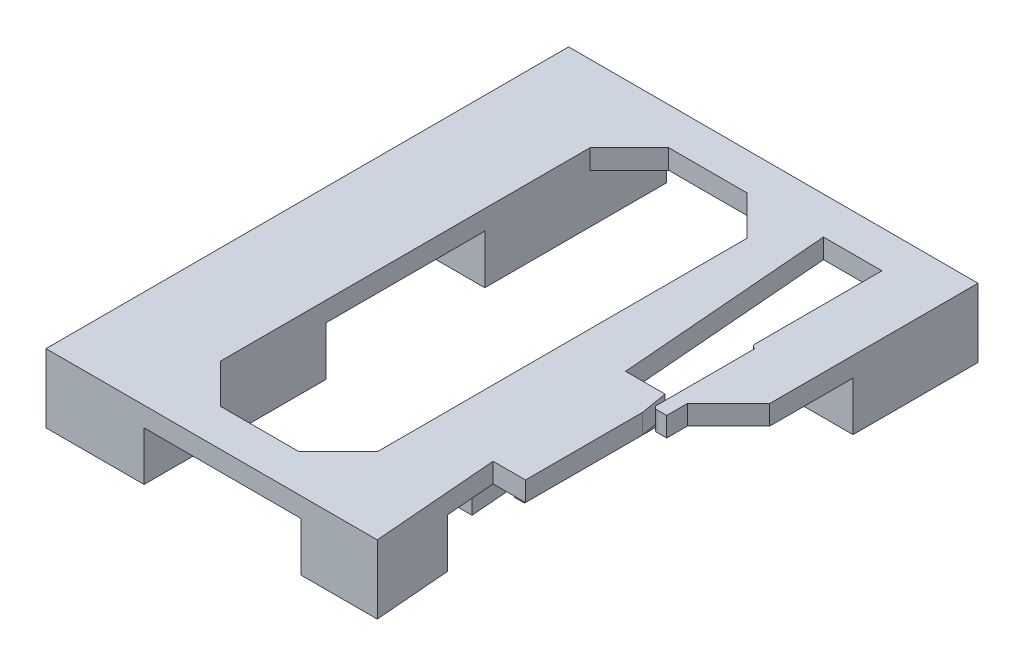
ISO-10303-21;
HEADER;
FILE_DESCRIPTION(('STEP AP214'),'2;1');
FILE_NAME('part.step','',(''),(''),'','','');
FILE_SCHEMA(('AUTOMOTIVE_DESIGN { 1 0 10303 214 1 1 1 1 }'));
ENDSEC;
DATA;
#1=APPLICATION_CONTEXT('core data for automotive mechanical design processes');
#2=APPLICATION_PROTOCOL_DEFINITION('international standard','automotive_design',2000,#1);
#3=PRODUCT_CONTEXT('',#1,'mechanical');
#4=PRODUCT('Part','Part','',(#3));
#5=PRODUCT_RELATED_PRODUCT_CATEGORY('part','',(#4));
#6=PRODUCT_DEFINITION_FORMATION('','',#4);
#7=PRODUCT_DEFINITION_CONTEXT('part definition',#1,'design');
#8=PRODUCT_DEFINITION('design','',#6,#7);
#9=PRODUCT_DEFINITION_SHAPE('','',#8);
#10=(LENGTH_UNIT() NAMED_UNIT(*) SI_UNIT(.MILLI.,.METRE.));
#11=(NAMED_UNIT(*) PLANE_ANGLE_UNIT() SI_UNIT($,.RADIAN.));
#12=(NAMED_UNIT(*) SI_UNIT($,.STERADIAN.) SOLID_ANGLE_UNIT());
#13=UNCERTAINTY_MEASURE_WITH_UNIT(LENGTH_MEASURE(1.E-05),#10,'distance_accuracy_value','');
#14=(GEOMETRIC_REPRESENTATION_CONTEXT(3) GLOBAL_UNCERTAINTY_ASSIGNED_CONTEXT((#13)) GLOBAL_UNIT_ASSIGNED_CONTEXT((#10,
#11,#12)) REPRESENTATION_CONTEXT('',''));
#15=CARTESIAN_POINT('',(0.,0.,0.));
#16=DIRECTION('',(0.,0.,1.));
#17=DIRECTION('',(1.,0.,0.));
#18=AXIS2_PLACEMENT_3D('',#15,#16,#17);
#19=CARTESIAN_POINT('',(0.,0.,0.));
#20=DIRECTION('',(0.,1.,0.));
#21=DIRECTION('',(0.,0.,1.));
#22=AXIS2_PLACEMENT_3D('',#19,#20,#21);
#23=PLANE('',#22);
#24=DIRECTION('',(0.,0.,-1.));
#25=VECTOR('',#24,1.);
#26=CARTESIAN_POINT('',(41.85,0.,0.));
#27=LINE('',#26,#25);
#28=CARTESIAN_POINT('',(41.85,0.,-9.9));
#29=VERTEX_POINT('',#28);
#30=CARTESIAN_POINT('',(41.85,0.,-13.9));
#31=VERTEX_POINT('',#30);
#32=EDGE_CURVE('E661',#29,#31,#27,.T.);
#33=ORIENTED_EDGE('',*,*,#32,.T.);
#34=DIRECTION('',(1.,0.,0.));
#35=VECTOR('',#34,1.);
#36=CARTESIAN_POINT('',(47.85,0.,-13.9));
#37=LINE('',#36,#35);
#38=CARTESIAN_POINT('',(47.85,0.,-13.9));
#39=VERTEX_POINT('',#38);
#40=EDGE_CURVE('E50',#31,#39,#37,.T.);
#41=ORIENTED_EDGE('',*,*,#40,.T.);
#42=DIRECTION('',(0.,0.,-1.));
#43=VECTOR('',#42,1.);
#44=CARTESIAN_POINT('',(47.85,0.,0.));
#45=LINE('',#44,#43);
#46=CARTESIAN_POINT('',(47.85,0.,-5.40000000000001));
#47=VERTEX_POINT('',#46);
#48=EDGE_CURVE('E690',#47,#39,#45,.T.);
#49=ORIENTED_EDGE('',*,*,#48,.F.);
#50=DIRECTION('',(-0.707106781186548,0.,0.707106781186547));
#51=VECTOR('',#50,1.);
#52=CARTESIAN_POINT('',(21.225,0.,21.225));
#53=LINE('',#52,#51);
#54=CARTESIAN_POINT('',(43.65,0.,-1.2));
#55=VERTEX_POINT('',#54);
#56=EDGE_CURVE('E692',#47,#55,#53,.T.);
#57=ORIENTED_EDGE('',*,*,#56,.T.);
#58=DIRECTION('',(0.,0.,1.));
#59=VECTOR('',#58,1.);
#60=CARTESIAN_POINT('',(43.65,0.,0.));
#61=LINE('',#60,#59);
#62=CARTESIAN_POINT('',(43.65,0.,0.9));
#63=VERTEX_POINT('',#62);
#64=EDGE_CURVE('E695',#55,#63,#61,.T.);
#65=ORIENTED_EDGE('',*,*,#64,.T.);
#66=DIRECTION('',(1.,0.,0.));
#67=VECTOR('',#66,1.);
#68=CARTESIAN_POINT('',(0.,0.,0.900000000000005));
#69=LINE('',#68,#67);
#70=CARTESIAN_POINT('',(42.65,0.,0.9));
#71=VERTEX_POINT('',#70);
#72=EDGE_CURVE('E698',#71,#63,#69,.T.);
#73=ORIENTED_EDGE('',*,*,#72,.F.);
#74=CARTESIAN_POINT('',(42.65,0.,0.5));
#75=DIRECTION('',(0.,1.,0.));
#76=DIRECTION('',(0.,0.,1.));
#77=AXIS2_PLACEMENT_3D('',#74,#75,#76);
#78=CIRCLE('',#77,0.399999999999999);
#79=CARTESIAN_POINT('',(42.25,0.,0.500000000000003));
#80=VERTEX_POINT('',#79);
#81=EDGE_CURVE('E701',#80,#71,#78,.T.);
#82=ORIENTED_EDGE('',*,*,#81,.F.);
#83=DIRECTION('',(1.,0.,0.));
#84=VECTOR('',#83,1.);
#85=CARTESIAN_POINT('',(43.25,0.,0.499999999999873));
#86=LINE('',#85,#84);
#87=CARTESIAN_POINT('',(43.25,0.,0.499999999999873));
#88=VERTEX_POINT('',#87);
#89=EDGE_CURVE('E426',#80,#88,#86,.T.);
#90=ORIENTED_EDGE('',*,*,#89,.T.);
#91=DIRECTION('',(0.,0.,-1.));
#92=VECTOR('',#91,1.);
#93=CARTESIAN_POINT('',(43.25,0.,-13.5000000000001));
#94=LINE('',#93,#92);
#95=CARTESIAN_POINT('',(43.25,0.,-13.5000000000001));
#96=VERTEX_POINT('',#95);
#97=EDGE_CURVE('E415',#88,#96,#94,.T.);
#98=ORIENTED_EDGE('',*,*,#97,.T.);
#99=DIRECTION('',(-1.,0.,0.));
#100=VECTOR('',#99,1.);
#101=CARTESIAN_POINT('',(43.25,0.,-13.5000000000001));
#102=LINE('',#101,#100);
#103=CARTESIAN_POINT('',(42.25,0.,-13.5000000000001));
#104=VERTEX_POINT('',#103);
#105=EDGE_CURVE('E438',#96,#104,#102,.T.);
#106=ORIENTED_EDGE('',*,*,#105,.T.);
#107=DIRECTION('',(0.,0.,1.));
#108=VECTOR('',#107,1.);
#109=CARTESIAN_POINT('',(42.25,0.,-13.5000000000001));
#110=LINE('',#109,#108);
#111=CARTESIAN_POINT('',(42.25,0.,-9.5));
#112=VERTEX_POINT('',#111);
#113=EDGE_CURVE('E441',#104,#112,#110,.T.);
#114=ORIENTED_EDGE('',*,*,#113,.T.);
#115=CARTESIAN_POINT('',(42.25,0.,-9.89999999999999));
#116=DIRECTION('',(0.,1.,0.));
#117=DIRECTION('',(0.,0.,1.));
#118=AXIS2_PLACEMENT_3D('',#115,#116,#117);
#119=CIRCLE('',#118,0.399999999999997);
#120=EDGE_CURVE('E657',#29,#112,#119,.T.);
#121=ORIENTED_EDGE('',*,*,#120,.F.);
#122=EDGE_LOOP('',(#33,#41,#49,#57,#65,#73,#82,#90,#98,#106,#114,#121));
#123=FACE_BOUND('',#122,.T.);
#124=ADVANCED_FACE('F35',(#123),#23,.F.);
#125=DIRECTION('',(0.707106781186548,0.,-0.707106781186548));
#126=VECTOR('',#125,1.);
#127=CARTESIAN_POINT('',(25.475,0.,25.475));
#128=LINE('',#127,#126);
#129=CARTESIAN_POINT('',(28.1,0.,22.85));
#130=VERTEX_POINT('',#129);
#131=CARTESIAN_POINT('',(32.1,0.,18.85));
#132=VERTEX_POINT('',#131);
#133=EDGE_CURVE('E589',#130,#132,#128,.T.);
#134=ORIENTED_EDGE('',*,*,#133,.T.);
#135=DIRECTION('',(0.,0.,1.));
#136=VECTOR('',#135,1.);
#137=CARTESIAN_POINT('',(32.1,0.,18.85));
#138=LINE('',#137,#136);
#139=CARTESIAN_POINT('',(32.1,0.,26.65));
#140=VERTEX_POINT('',#139);
#141=EDGE_CURVE('E458',#132,#140,#138,.T.);
#142=ORIENTED_EDGE('',*,*,#141,.T.);
#143=DIRECTION('',(-1.,0.,0.));
#144=VECTOR('',#143,1.);
#145=CARTESIAN_POINT('',(0.,0.,26.65));
#146=LINE('',#145,#144);
#147=CARTESIAN_POINT('',(16.1,0.,26.65));
#148=VERTEX_POINT('',#147);
#149=EDGE_CURVE('E684',#140,#148,#146,.T.);
#150=ORIENTED_EDGE('',*,*,#149,.T.);
#151=DIRECTION('',(0.,0.,-1.));
#152=VECTOR('',#151,1.);
#153=CARTESIAN_POINT('',(16.1,0.,8.1));
#154=LINE('',#153,#152);
#155=CARTESIAN_POINT('',(16.1,0.,18.85));
#156=VERTEX_POINT('',#155);
#157=EDGE_CURVE('E474',#148,#156,#154,.T.);
#158=ORIENTED_EDGE('',*,*,#157,.T.);
#159=DIRECTION('',(0.707106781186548,0.,0.707106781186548));
#160=VECTOR('',#159,1.);
#161=CARTESIAN_POINT('',(-1.37499999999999,0.,1.37499999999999));
#162=LINE('',#161,#160);
#163=CARTESIAN_POINT('',(20.1,0.,22.85));
#164=VERTEX_POINT('',#163);
#165=EDGE_CURVE('E709',#156,#164,#162,.T.);
#166=ORIENTED_EDGE('',*,*,#165,.T.);
#167=DIRECTION('',(1.,0.,0.));
#168=VECTOR('',#167,1.);
#169=CARTESIAN_POINT('',(0.,0.,22.85));
#170=LINE('',#169,#168);
#171=EDGE_CURVE('E711',#164,#130,#170,.T.);
#172=ORIENTED_EDGE('',*,*,#171,.T.);
#173=EDGE_LOOP('',(#134,#142,#150,#158,#166,#172));
#174=FACE_BOUND('',#173,.T.);
#175=ADVANCED_FACE('F717',(#174),#23,.F.);
#176=DIRECTION('',(1.,0.,0.));
#177=VECTOR('',#176,1.);
#178=CARTESIAN_POINT('',(0.,0.,-26.65));
#179=LINE('',#178,#177);
#180=CARTESIAN_POINT('',(16.0999999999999,0.,-26.65));
#181=VERTEX_POINT('',#180);
#182=CARTESIAN_POINT('',(41.85,0.,-26.65));
#183=VERTEX_POINT('',#182);
#184=EDGE_CURVE('E57',#181,#183,#179,.T.);
#185=ORIENTED_EDGE('',*,*,#184,.T.);
#186=DIRECTION('',(0.,0.,1.));
#187=VECTOR('',#186,1.);
#188=CARTESIAN_POINT('',(41.85,0.,-26.65));
#189=LINE('',#188,#187);
#190=CARTESIAN_POINT('',(41.85,0.,-22.85));
#191=VERTEX_POINT('',#190);
#192=EDGE_CURVE('E375',#183,#191,#189,.T.);
#193=ORIENTED_EDGE('',*,*,#192,.T.);
#194=DIRECTION('',(-1.,0.,0.));
#195=VECTOR('',#194,1.);
#196=CARTESIAN_POINT('',(0.,0.,-22.85));
#197=LINE('',#196,#195);
#198=CARTESIAN_POINT('',(35.8916122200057,0.,-22.85));
#199=VERTEX_POINT('',#198);
#200=EDGE_CURVE('E663',#191,#199,#197,.T.);
#201=ORIENTED_EDGE('',*,*,#200,.T.);
#202=DIRECTION('',(0.080371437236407,0.,0.996764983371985));
#203=VECTOR('',#202,1.);
#204=CARTESIAN_POINT('',(37.4903141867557,0.,-3.02292966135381));
#205=LINE('',#204,#203);
#206=CARTESIAN_POINT('',(37.6614908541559,0.,-0.900000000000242));
#207=VERTEX_POINT('',#206);
#208=EDGE_CURVE('E666',#199,#207,#205,.T.);
#209=ORIENTED_EDGE('',*,*,#208,.T.);
#210=DIRECTION('',(1.,0.,0.));
#211=VECTOR('',#210,1.);
#212=CARTESIAN_POINT('',(0.,0.,-0.900000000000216));
#213=LINE('',#212,#211);
#214=CARTESIAN_POINT('',(41.6825842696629,0.,-0.900000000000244));
#215=VERTEX_POINT('',#214);
#216=EDGE_CURVE('E669',#207,#215,#213,.T.);
#217=ORIENTED_EDGE('',*,*,#216,.T.);
#218=DIRECTION('',(0.166195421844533,0.,0.986092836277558));
#219=VECTOR('',#218,1.);
#220=CARTESIAN_POINT('',(40.6787687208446,0.,-6.85597225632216));
#221=LINE('',#220,#219);
#222=CARTESIAN_POINT('',(41.75,0.,-0.500000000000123));
#223=VERTEX_POINT('',#222);
#224=EDGE_CURVE('E672',#215,#223,#221,.T.);
#225=ORIENTED_EDGE('',*,*,#224,.T.);
#226=DIRECTION('',(-1.,0.,0.));
#227=VECTOR('',#226,1.);
#228=CARTESIAN_POINT('',(40.7499999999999,0.,-0.500000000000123));
#229=LINE('',#228,#227);
#230=CARTESIAN_POINT('',(40.7499999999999,0.,-0.500000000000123));
#231=VERTEX_POINT('',#230);
#232=EDGE_CURVE('E393',#223,#231,#229,.T.);
#233=ORIENTED_EDGE('',*,*,#232,.T.);
#234=DIRECTION('',(0.,0.,1.));
#235=VECTOR('',#234,1.);
#236=CARTESIAN_POINT('',(40.7499999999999,0.,-0.500000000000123));
#237=LINE('',#236,#235);
#238=CARTESIAN_POINT('',(40.7499999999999,0.,13.4999999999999));
#239=VERTEX_POINT('',#238);
#240=EDGE_CURVE('E384',#231,#239,#237,.T.);
#241=ORIENTED_EDGE('',*,*,#240,.T.);
#242=DIRECTION('',(1.,0.,0.));
#243=VECTOR('',#242,1.);
#244=CARTESIAN_POINT('',(40.7499999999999,0.,13.4999999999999));
#245=LINE('',#244,#243);
#246=CARTESIAN_POINT('',(41.75,0.,13.4999999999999));
#247=VERTEX_POINT('',#246);
#248=EDGE_CURVE('E405',#239,#247,#245,.T.);
#249=ORIENTED_EDGE('',*,*,#248,.T.);
#250=DIRECTION('',(0.,0.,-1.));
#251=VECTOR('',#250,1.);
#252=CARTESIAN_POINT('',(41.75,0.,-0.500000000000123));
#253=LINE('',#252,#251);
#254=EDGE_CURVE('E408',#247,#223,#253,.T.);
#255=ORIENTED_EDGE('',*,*,#254,.T.);
#256=CARTESIAN_POINT('',(42.15,0.,1.8733333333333));
#257=VERTEX_POINT('',#256);
#258=EDGE_CURVE('E675',#223,#257,#221,.T.);
#259=ORIENTED_EDGE('',*,*,#258,.T.);
#260=DIRECTION('',(0.,0.,1.));
#261=VECTOR('',#260,1.);
#262=CARTESIAN_POINT('',(42.15,0.,0.));
#263=LINE('',#262,#261);
#264=CARTESIAN_POINT('',(42.15,0.,13.8));
#265=VERTEX_POINT('',#264);
#266=EDGE_CURVE('E676',#257,#265,#263,.T.);
#267=ORIENTED_EDGE('',*,*,#266,.T.);
#268=DIRECTION('',(-1.,0.,0.));
#269=VECTOR('',#268,1.);
#270=CARTESIAN_POINT('',(0.,0.,13.8));
#271=LINE('',#270,#269);
#272=CARTESIAN_POINT('',(38.8467854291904,0.,13.8));
#273=VERTEX_POINT('',#272);
#274=EDGE_CURVE('E679',#265,#273,#271,.T.);
#275=ORIENTED_EDGE('',*,*,#274,.T.);
#276=DIRECTION('',(-0.080371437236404,0.,-0.996764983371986));
#277=VECTOR('',#276,1.);
#278=CARTESIAN_POINT('',(37.4903141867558,0.,-3.02292966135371));
#279=LINE('',#278,#277);
#280=CARTESIAN_POINT('',(39.253978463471,0.,18.85));
#281=VERTEX_POINT('',#280);
#282=EDGE_CURVE('E682',#281,#273,#279,.T.);
#283=ORIENTED_EDGE('',*,*,#282,.F.);
#284=DIRECTION('',(-1.,0.,0.));
#285=VECTOR('',#284,1.);
#286=CARTESIAN_POINT('',(39.253978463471,0.,18.85));
#287=LINE('',#286,#285);
#288=EDGE_CURVE('E447',#281,#132,#287,.T.);
#289=ORIENTED_EDGE('',*,*,#288,.T.);
#290=DIRECTION('',(0.,0.,-1.));
#291=VECTOR('',#290,1.);
#292=CARTESIAN_POINT('',(32.1,0.,0.));
#293=LINE('',#292,#291);
#294=CARTESIAN_POINT('',(32.0999999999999,0.,12.65));
#295=VERTEX_POINT('',#294);
#296=EDGE_CURVE('E568',#132,#295,#293,.T.);
#297=ORIENTED_EDGE('',*,*,#296,.T.);
#298=DIRECTION('',(1.,0.,0.));
#299=VECTOR('',#298,1.);
#300=CARTESIAN_POINT('',(32.0999999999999,0.,12.65));
#301=LINE('',#300,#299);
#302=CARTESIAN_POINT('',(35.5485089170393,0.,12.65));
#303=VERTEX_POINT('',#302);
#304=EDGE_CURVE('E520',#295,#303,#301,.T.);
#305=ORIENTED_EDGE('',*,*,#304,.T.);
#306=DIRECTION('',(-0.080371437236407,0.,-0.996764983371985));
#307=VECTOR('',#306,1.);
#308=CARTESIAN_POINT('',(35.5485089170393,0.,12.65));
#309=LINE('',#308,#307);
#310=CARTESIAN_POINT('',(35.1896952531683,0.,8.2));
#311=VERTEX_POINT('',#310);
#312=EDGE_CURVE('E538',#303,#311,#309,.T.);
#313=ORIENTED_EDGE('',*,*,#312,.T.);
#314=DIRECTION('',(-1.,0.,0.));
#315=VECTOR('',#314,1.);
#316=CARTESIAN_POINT('',(32.1,0.,8.2));
#317=LINE('',#316,#315);
#318=CARTESIAN_POINT('',(32.1,0.,8.2));
#319=VERTEX_POINT('',#318);
#320=EDGE_CURVE('E528',#311,#319,#317,.T.);
#321=ORIENTED_EDGE('',*,*,#320,.T.);
#322=CARTESIAN_POINT('',(32.1,0.,-18.85));
#323=VERTEX_POINT('',#322);
#324=EDGE_CURVE('E549',#319,#323,#293,.T.);
#325=ORIENTED_EDGE('',*,*,#324,.T.);
#326=DIRECTION('',(0.707106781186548,0.,0.707106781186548));
#327=VECTOR('',#326,1.);
#328=CARTESIAN_POINT('',(25.475,0.,-25.475));
#329=LINE('',#328,#327);
#330=CARTESIAN_POINT('',(28.1,0.,-22.85));
#331=VERTEX_POINT('',#330);
#332=EDGE_CURVE('E588',#331,#323,#329,.T.);
#333=ORIENTED_EDGE('',*,*,#332,.F.);
#334=DIRECTION('',(1.,0.,0.));
#335=VECTOR('',#334,1.);
#336=CARTESIAN_POINT('',(0.,0.,-22.85));
#337=LINE('',#336,#335);
#338=CARTESIAN_POINT('',(20.1,0.,-22.85));
#339=VERTEX_POINT('',#338);
#340=EDGE_CURVE('E554',#339,#331,#337,.T.);
#341=ORIENTED_EDGE('',*,*,#340,.F.);
#342=DIRECTION('',(-0.707106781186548,0.,0.707106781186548));
#343=VECTOR('',#342,1.);
#344=CARTESIAN_POINT('',(-1.375,0.,-1.375));
#345=LINE('',#344,#343);
#346=CARTESIAN_POINT('',(16.0999999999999,0.,-18.8499999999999));
#347=VERTEX_POINT('',#346);
#348=EDGE_CURVE('E703',#339,#347,#345,.T.);
#349=ORIENTED_EDGE('',*,*,#348,.T.);
#350=DIRECTION('',(0.,0.,-1.));
#351=VECTOR('',#350,1.);
#352=CARTESIAN_POINT('',(16.0999999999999,0.,0.));
#353=LINE('',#352,#351);
#354=EDGE_CURVE('E11',#347,#181,#353,.T.);
#355=ORIENTED_EDGE('',*,*,#354,.T.);
#356=EDGE_LOOP('',(#185,#193,#201,#209,#217,#225,#233,#241,#249,#255,#259,#267,#275,#283,#289,
#297,#305,#313,#321,#325,#333,#341,#349,#355));
#357=FACE_BOUND('',#356,.T.);
#358=ADVANCED_FACE('F565',(#357),#23,.F.);
#359=CARTESIAN_POINT('',(42.25,2.,0.));
#360=DIRECTION('',(1.,0.,0.));
#361=DIRECTION('',(0.,0.,-1.));
#362=AXIS2_PLACEMENT_3D('',#359,#360,#361);
#363=PLANE('',#362);
#364=DIRECTION('',(0.,-1.,0.));
#365=VECTOR('',#364,1.);
#366=CARTESIAN_POINT('',(42.25,2.,-9.5));
#367=LINE('',#366,#365);
#368=CARTESIAN_POINT('',(42.25,2.,-9.5));
#369=VERTEX_POINT('',#368);
#370=EDGE_CURVE('E603',#369,#112,#367,.T.);
#371=ORIENTED_EDGE('',*,*,#370,.T.);
#372=ORIENTED_EDGE('',*,*,#113,.F.);
#373=DIRECTION('',(0.,1.,0.));
#374=VECTOR('',#373,1.);
#375=CARTESIAN_POINT('',(42.25,-0.4,-13.5000000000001));
#376=LINE('',#375,#374);
#377=CARTESIAN_POINT('',(42.25,-0.4,-13.5000000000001));
#378=VERTEX_POINT('',#377);
#379=EDGE_CURVE('E451',#378,#104,#376,.T.);
#380=ORIENTED_EDGE('',*,*,#379,.F.);
#381=DIRECTION('',(0.,0.,1.));
#382=VECTOR('',#381,1.);
#383=CARTESIAN_POINT('',(42.25,-0.4,-13.5000000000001));
#384=LINE('',#383,#382);
#385=CARTESIAN_POINT('',(42.25,-0.4,0.499999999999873));
#386=VERTEX_POINT('',#385);
#387=EDGE_CURVE('E429',#378,#386,#384,.T.);
#388=ORIENTED_EDGE('',*,*,#387,.T.);
#389=DIRECTION('',(0.,1.,0.));
#390=VECTOR('',#389,1.);
#391=CARTESIAN_POINT('',(42.25,-0.4,0.499999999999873));
#392=LINE('',#391,#390);
#393=EDGE_CURVE('E448',#386,#80,#392,.T.);
#394=ORIENTED_EDGE('',*,*,#393,.T.);
#395=DIRECTION('',(0.,-1.,0.));
#396=VECTOR('',#395,1.);
#397=CARTESIAN_POINT('',(42.25,2.,0.500000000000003));
#398=LINE('',#397,#396);
#399=CARTESIAN_POINT('',(42.25,2.,0.500000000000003));
#400=VERTEX_POINT('',#399);
#401=EDGE_CURVE('E43',#400,#80,#398,.T.);
#402=ORIENTED_EDGE('',*,*,#401,.F.);
#403=DIRECTION('',(0.,0.,1.));
#404=VECTOR('',#403,1.);
#405=CARTESIAN_POINT('',(42.25,2.,0.));
#406=LINE('',#405,#404);
#407=EDGE_CURVE('E823',#369,#400,#406,.T.);
#408=ORIENTED_EDGE('',*,*,#407,.F.);
#409=EDGE_LOOP('',(#371,#372,#380,#388,#394,#402,#408));
#410=FACE_BOUND('',#409,.T.);
#411=ADVANCED_FACE('F758',(#410),#363,.F.);
#412=CARTESIAN_POINT('',(42.65,2.,0.5));
#413=DIRECTION('',(0.,-1.,0.));
#414=DIRECTION('',(0.,0.,-1.));
#415=AXIS2_PLACEMENT_3D('',#412,#413,#414);
#416=CYLINDRICAL_SURFACE('',#415,0.399999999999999);
#417=ORIENTED_EDGE('',*,*,#81,.T.);
#418=DIRECTION('',(0.,-1.,0.));
#419=VECTOR('',#418,1.);
#420=CARTESIAN_POINT('',(42.65,2.,0.9));
#421=LINE('',#420,#419);
#422=CARTESIAN_POINT('',(42.65,2.,0.9));
#423=VERTEX_POINT('',#422);
#424=EDGE_CURVE('E623',#423,#71,#421,.T.);
#425=ORIENTED_EDGE('',*,*,#424,.F.);
#426=CARTESIAN_POINT('',(42.65,2.,0.5));
#427=DIRECTION('',(0.,1.,0.));
#428=DIRECTION('',(0.,0.,1.));
#429=AXIS2_PLACEMENT_3D('',#426,#427,#428);
#430=CIRCLE('',#429,0.399999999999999);
#431=EDGE_CURVE('E831',#400,#423,#430,.T.);
#432=ORIENTED_EDGE('',*,*,#431,.F.);
#433=ORIENTED_EDGE('',*,*,#401,.T.);
#434=EDGE_LOOP('',(#417,#425,#432,#433));
#435=FACE_BOUND('',#434,.T.);
#436=ADVANCED_FACE('F762',(#435),#416,.T.);
#437=CARTESIAN_POINT('',(0.,2.,0.900000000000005));
#438=DIRECTION('',(0.,0.,-1.));
#439=DIRECTION('',(-1.,0.,0.));
#440=AXIS2_PLACEMENT_3D('',#437,#438,#439);
#441=PLANE('',#440);
#442=ORIENTED_EDGE('',*,*,#72,.T.);
#443=DIRECTION('',(0.,-1.,0.));
#444=VECTOR('',#443,1.);
#445=CARTESIAN_POINT('',(43.65,2.,0.9));
#446=LINE('',#445,#444);
#447=CARTESIAN_POINT('',(43.65,2.,0.9));
#448=VERTEX_POINT('',#447);
#449=EDGE_CURVE('E626',#448,#63,#446,.T.);
#450=ORIENTED_EDGE('',*,*,#449,.F.);
#451=DIRECTION('',(1.,0.,0.));
#452=VECTOR('',#451,1.);
#453=CARTESIAN_POINT('',(0.,2.,0.900000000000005));
#454=LINE('',#453,#452);
#455=EDGE_CURVE('E833',#423,#448,#454,.T.);
#456=ORIENTED_EDGE('',*,*,#455,.F.);
#457=ORIENTED_EDGE('',*,*,#424,.T.);
#458=EDGE_LOOP('',(#442,#450,#456,#457));
#459=FACE_BOUND('',#458,.T.);
#460=ADVANCED_FACE('F768',(#459),#441,.F.);
#461=CARTESIAN_POINT('',(43.65,2.,0.));
#462=DIRECTION('',(1.,0.,0.));
#463=DIRECTION('',(0.,0.,-1.));
#464=AXIS2_PLACEMENT_3D('',#461,#462,#463);
#465=PLANE('',#464);
#466=ORIENTED_EDGE('',*,*,#64,.F.);
#467=DIRECTION('',(0.,-1.,0.));
#468=VECTOR('',#467,1.);
#469=CARTESIAN_POINT('',(43.65,2.,-1.2));
#470=LINE('',#469,#468);
#471=CARTESIAN_POINT('',(43.65,2.,-1.2));
#472=VERTEX_POINT('',#471);
#473=EDGE_CURVE('E628',#472,#55,#470,.T.);
#474=ORIENTED_EDGE('',*,*,#473,.F.);
#475=DIRECTION('',(0.,0.,1.));
#476=VECTOR('',#475,1.);
#477=CARTESIAN_POINT('',(43.65,2.,0.));
#478=LINE('',#477,#476);
#479=EDGE_CURVE('E835',#472,#448,#478,.T.);
#480=ORIENTED_EDGE('',*,*,#479,.T.);
#481=ORIENTED_EDGE('',*,*,#449,.T.);
#482=EDGE_LOOP('',(#466,#474,#480,#481));
#483=FACE_BOUND('',#482,.T.);
#484=ADVANCED_FACE('F890',(#483),#465,.T.);
#485=CARTESIAN_POINT('',(21.225,2.,21.225));
#486=DIRECTION('',(0.707106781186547,0.,0.707106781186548));
#487=DIRECTION('',(0.707106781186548,0.,-0.707106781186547));
#488=AXIS2_PLACEMENT_3D('',#485,#486,#487);
#489=PLANE('',#488);
#490=ORIENTED_EDGE('',*,*,#56,.F.);
#491=DIRECTION('',(0.,-1.,0.));
#492=VECTOR('',#491,1.);
#493=CARTESIAN_POINT('',(47.85,2.,-5.40000000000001));
#494=LINE('',#493,#492);
#495=CARTESIAN_POINT('',(47.85,2.,-5.40000000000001));
#496=VERTEX_POINT('',#495);
#497=EDGE_CURVE('E358',#496,#47,#494,.T.);
#498=ORIENTED_EDGE('',*,*,#497,.F.);
#499=DIRECTION('',(-0.707106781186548,0.,0.707106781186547));
#500=VECTOR('',#499,1.);
#501=CARTESIAN_POINT('',(21.225,2.,21.225));
#502=LINE('',#501,#500);
#503=EDGE_CURVE('E838',#496,#472,#502,.T.);
#504=ORIENTED_EDGE('',*,*,#503,.T.);
#505=ORIENTED_EDGE('',*,*,#473,.T.);
#506=EDGE_LOOP('',(#490,#498,#504,#505));
#507=FACE_BOUND('',#506,.T.);
#508=ADVANCED_FACE('F893',(#507),#489,.T.);
#509=CARTESIAN_POINT('',(47.85,2.,0.));
#510=DIRECTION('',(-1.,0.,0.));
#511=DIRECTION('',(0.,0.,1.));
#512=AXIS2_PLACEMENT_3D('',#509,#510,#511);
#513=PLANE('',#512);
#514=ORIENTED_EDGE('',*,*,#48,.T.);
#515=DIRECTION('',(0.,1.,0.));
#516=VECTOR('',#515,1.);
#517=CARTESIAN_POINT('',(47.85,-5.,-13.9));
#518=LINE('',#517,#516);
#519=CARTESIAN_POINT('',(47.85,-5.,-13.9));
#520=VERTEX_POINT('',#519);
#521=EDGE_CURVE('E373',#520,#39,#518,.T.);
#522=ORIENTED_EDGE('',*,*,#521,.F.);
#523=DIRECTION('',(0.,0.,-1.));
#524=VECTOR('',#523,1.);
#525=CARTESIAN_POINT('',(47.85,-5.,-26.65));
#526=LINE('',#525,#524);
#527=CARTESIAN_POINT('',(47.85,-5.,-26.65));
#528=VERTEX_POINT('',#527);
#529=EDGE_CURVE('E366',#520,#528,#526,.T.);
#530=ORIENTED_EDGE('',*,*,#529,.T.);
#531=DIRECTION('',(0.,-1.,0.));
#532=VECTOR('',#531,1.);
#533=CARTESIAN_POINT('',(47.85,2.,-26.65));
#534=LINE('',#533,#532);
#535=CARTESIAN_POINT('',(47.85,2.,-26.65));
#536=VERTEX_POINT('',#535);
#537=EDGE_CURVE('E349',#536,#528,#534,.T.);
#538=ORIENTED_EDGE('',*,*,#537,.F.);
#539=DIRECTION('',(0.,0.,-1.));
#540=VECTOR('',#539,1.);
#541=CARTESIAN_POINT('',(47.85,2.,0.));
#542=LINE('',#541,#540);
#543=EDGE_CURVE('E841',#496,#536,#542,.T.);
#544=ORIENTED_EDGE('',*,*,#543,.F.);
#545=ORIENTED_EDGE('',*,*,#497,.T.);
#546=EDGE_LOOP('',(#514,#522,#530,#538,#544,#545));
#547=FACE_BOUND('',#546,.T.);
#548=ADVANCED_FACE('F371',(#547),#513,.F.);
#549=CARTESIAN_POINT('',(0.,2.,-26.65));
#550=DIRECTION('',(0.,0.,-1.));
#551=DIRECTION('',(-1.,0.,0.));
#552=AXIS2_PLACEMENT_3D('',#549,#550,#551);
#553=PLANE('',#552);
#554=ORIENTED_EDGE('',*,*,#184,.F.);
#555=DIRECTION('',(0.,1.,0.));
#556=VECTOR('',#555,1.);
#557=CARTESIAN_POINT('',(16.0999999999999,-5.,-26.65));
#558=LINE('',#557,#556);
#559=CARTESIAN_POINT('',(16.0999999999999,-5.,-26.65));
#560=VERTEX_POINT('',#559);
#561=EDGE_CURVE('E521',#560,#181,#558,.T.);
#562=ORIENTED_EDGE('',*,*,#561,.F.);
#563=DIRECTION('',(-1.,0.,0.));
#564=VECTOR('',#563,1.);
#565=CARTESIAN_POINT('',(16.0999999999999,-5.,-26.65));
#566=LINE('',#565,#564);
#567=CARTESIAN_POINT('',(6.09999999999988,-5.,-26.65));
#568=VERTEX_POINT('',#567);
#569=EDGE_CURVE('E509',#560,#568,#566,.T.);
#570=ORIENTED_EDGE('',*,*,#569,.T.);
#571=DIRECTION('',(0.,-1.,0.));
#572=VECTOR('',#571,1.);
#573=CARTESIAN_POINT('',(6.10000000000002,2.,-26.65));
#574=LINE('',#573,#572);
#575=CARTESIAN_POINT('',(6.10000000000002,2.,-26.65));
#576=VERTEX_POINT('',#575);
#577=EDGE_CURVE('E359',#576,#568,#574,.T.);
#578=ORIENTED_EDGE('',*,*,#577,.F.);
#579=DIRECTION('',(1.,0.,0.));
#580=VECTOR('',#579,1.);
#581=CARTESIAN_POINT('',(0.,2.,-26.65));
#582=LINE('',#581,#580);
#583=EDGE_CURVE('E354',#576,#536,#582,.T.);
#584=ORIENTED_EDGE('',*,*,#583,.T.);
#585=ORIENTED_EDGE('',*,*,#537,.T.);
#586=DIRECTION('',(-1.,0.,0.));
#587=VECTOR('',#586,1.);
#588=CARTESIAN_POINT('',(47.85,-5.,-26.65));
#589=LINE('',#588,#587);
#590=CARTESIAN_POINT('',(41.85,-5.,-26.65));
#591=VERTEX_POINT('',#590);
#592=EDGE_CURVE('E352',#528,#591,#589,.T.);
#593=ORIENTED_EDGE('',*,*,#592,.T.);
#594=DIRECTION('',(0.,1.,0.));
#595=VECTOR('',#594,1.);
#596=CARTESIAN_POINT('',(41.85,-5.,-26.65));
#597=LINE('',#596,#595);
#598=EDGE_CURVE('E381',#591,#183,#597,.T.);
#599=ORIENTED_EDGE('',*,*,#598,.T.);
#600=EDGE_LOOP('',(#554,#562,#570,#578,#584,#585,#593,#599));
#601=FACE_BOUND('',#600,.T.);
#602=ADVANCED_FACE('F351',(#601),#553,.T.);
#603=CARTESIAN_POINT('',(6.10000000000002,2.,0.));
#604=DIRECTION('',(1.,0.,0.));
#605=DIRECTION('',(0.,0.,-1.));
#606=AXIS2_PLACEMENT_3D('',#603,#604,#605);
#607=PLANE('',#606);
#608=ORIENTED_EDGE('',*,*,#577,.T.);
#609=DIRECTION('',(0.,0.,1.));
#610=VECTOR('',#609,1.);
#611=CARTESIAN_POINT('',(6.09999999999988,-5.,-8.1));
#612=LINE('',#611,#610);
#613=CARTESIAN_POINT('',(6.09999999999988,-5.,-8.1));
#614=VERTEX_POINT('',#613);
#615=EDGE_CURVE('E512',#568,#614,#612,.T.);
#616=ORIENTED_EDGE('',*,*,#615,.T.);
#617=DIRECTION('',(0.,1.,0.));
#618=VECTOR('',#617,1.);
#619=CARTESIAN_POINT('',(6.09999999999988,-5.,-8.1));
#620=LINE('',#619,#618);
#621=CARTESIAN_POINT('',(6.09999999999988,0.,-8.1));
#622=VERTEX_POINT('',#621);
#623=EDGE_CURVE('E518',#614,#622,#620,.T.);
#624=ORIENTED_EDGE('',*,*,#623,.T.);
#625=DIRECTION('',(0.,0.,1.));
#626=VECTOR('',#625,1.);
#627=CARTESIAN_POINT('',(6.10000000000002,0.,0.));
#628=LINE('',#627,#626);
#629=CARTESIAN_POINT('',(6.10000000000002,0.,8.1));
#630=VERTEX_POINT('',#629);
#631=EDGE_CURVE('E686',#622,#630,#628,.T.);
#632=ORIENTED_EDGE('',*,*,#631,.T.);
#633=DIRECTION('',(0.,1.,0.));
#634=VECTOR('',#633,1.);
#635=CARTESIAN_POINT('',(6.10000000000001,-5.,8.1));
#636=LINE('',#635,#634);
#637=CARTESIAN_POINT('',(6.10000000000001,-5.,8.1));
#638=VERTEX_POINT('',#637);
#639=EDGE_CURVE('E500',#638,#630,#636,.T.);
#640=ORIENTED_EDGE('',*,*,#639,.F.);
#641=DIRECTION('',(0.,0.,1.));
#642=VECTOR('',#641,1.);
#643=CARTESIAN_POINT('',(6.10000000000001,-5.,8.1));
#644=LINE('',#643,#642);
#645=CARTESIAN_POINT('',(6.10000000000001,-5.,26.65));
#646=VERTEX_POINT('',#645);
#647=EDGE_CURVE('E486',#638,#646,#644,.T.);
#648=ORIENTED_EDGE('',*,*,#647,.T.);
#649=DIRECTION('',(0.,-1.,0.));
#650=VECTOR('',#649,1.);
#651=CARTESIAN_POINT('',(6.10000000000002,2.,26.65));
#652=LINE('',#651,#650);
#653=CARTESIAN_POINT('',(6.10000000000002,2.,26.65));
#654=VERTEX_POINT('',#653);
#655=EDGE_CURVE('E632',#654,#646,#652,.T.);
#656=ORIENTED_EDGE('',*,*,#655,.F.);
#657=DIRECTION('',(0.,0.,1.));
#658=VECTOR('',#657,1.);
#659=CARTESIAN_POINT('',(6.10000000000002,2.,0.));
#660=LINE('',#659,#658);
#661=EDGE_CURVE('E844',#576,#654,#660,.T.);
#662=ORIENTED_EDGE('',*,*,#661,.F.);
#663=EDGE_LOOP('',(#608,#616,#624,#632,#640,#648,#656,#662));
#664=FACE_BOUND('',#663,.T.);
#665=ADVANCED_FACE('F955',(#664),#607,.F.);
#666=CARTESIAN_POINT('',(0.,2.,26.65));
#667=DIRECTION('',(0.,0.,1.));
#668=DIRECTION('',(1.,0.,0.));
#669=AXIS2_PLACEMENT_3D('',#666,#667,#668);
#670=PLANE('',#669);
#671=ORIENTED_EDGE('',*,*,#149,.F.);
#672=DIRECTION('',(0.,1.,0.));
#673=VECTOR('',#672,1.);
#674=CARTESIAN_POINT('',(32.1,-5.,26.65));
#675=LINE('',#674,#673);
#676=CARTESIAN_POINT('',(32.1,-5.,26.65));
#677=VERTEX_POINT('',#676);
#678=EDGE_CURVE('E472',#677,#140,#675,.T.);
#679=ORIENTED_EDGE('',*,*,#678,.F.);
#680=DIRECTION('',(1.,0.,0.));
#681=VECTOR('',#680,1.);
#682=CARTESIAN_POINT('',(32.1,-5.,26.65));
#683=LINE('',#682,#681);
#684=CARTESIAN_POINT('',(39.8829102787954,-5.,26.65));
#685=VERTEX_POINT('',#684);
#686=EDGE_CURVE('E464',#677,#685,#683,.T.);
#687=ORIENTED_EDGE('',*,*,#686,.T.);
#688=DIRECTION('',(0.,-1.,0.));
#689=VECTOR('',#688,1.);
#690=CARTESIAN_POINT('',(39.8829102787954,2.,26.65));
#691=LINE('',#690,#689);
#692=CARTESIAN_POINT('',(39.8829102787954,2.,26.65));
#693=VERTEX_POINT('',#692);
#694=EDGE_CURVE('E634',#693,#685,#691,.T.);
#695=ORIENTED_EDGE('',*,*,#694,.F.);
#696=DIRECTION('',(-1.,0.,0.));
#697=VECTOR('',#696,1.);
#698=CARTESIAN_POINT('',(0.,2.,26.65));
#699=LINE('',#698,#697);
#700=EDGE_CURVE('E846',#693,#654,#699,.T.);
#701=ORIENTED_EDGE('',*,*,#700,.T.);
#702=ORIENTED_EDGE('',*,*,#655,.T.);
#703=DIRECTION('',(1.,0.,0.));
#704=VECTOR('',#703,1.);
#705=CARTESIAN_POINT('',(16.1,-5.,26.65));
#706=LINE('',#705,#704);
#707=CARTESIAN_POINT('',(16.1,-5.,26.65));
#708=VERTEX_POINT('',#707);
#709=EDGE_CURVE('E489',#646,#708,#706,.T.);
#710=ORIENTED_EDGE('',*,*,#709,.T.);
#711=DIRECTION('',(0.,1.,0.));
#712=VECTOR('',#711,1.);
#713=CARTESIAN_POINT('',(16.1,-5.,26.65));
#714=LINE('',#713,#712);
#715=EDGE_CURVE('E496',#708,#148,#714,.T.);
#716=ORIENTED_EDGE('',*,*,#715,.T.);
#717=EDGE_LOOP('',(#671,#679,#687,#695,#701,#702,#710,#716));
#718=FACE_BOUND('',#717,.T.);
#719=ADVANCED_FACE('F967',(#718),#670,.T.);
#720=CARTESIAN_POINT('',(37.4903141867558,2.,-3.02292966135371));
#721=DIRECTION('',(-0.996764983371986,0.,0.080371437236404));
#722=DIRECTION('',(0.080371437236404,0.,0.996764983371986));
#723=AXIS2_PLACEMENT_3D('',#720,#721,#722);
#724=PLANE('',#723);
#725=ORIENTED_EDGE('',*,*,#694,.T.);
#726=DIRECTION('',(-0.0803714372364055,0.,-0.996764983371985));
#727=VECTOR('',#726,1.);
#728=CARTESIAN_POINT('',(39.253978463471,-5.,18.85));
#729=LINE('',#728,#727);
#730=CARTESIAN_POINT('',(39.253978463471,-5.,18.85));
#731=VERTEX_POINT('',#730);
#732=EDGE_CURVE('E454',#685,#731,#729,.T.);
#733=ORIENTED_EDGE('',*,*,#732,.T.);
#734=DIRECTION('',(0.,1.,0.));
#735=VECTOR('',#734,1.);
#736=CARTESIAN_POINT('',(39.253978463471,-5.,18.85));
#737=LINE('',#736,#735);
#738=EDGE_CURVE('E467',#731,#281,#737,.T.);
#739=ORIENTED_EDGE('',*,*,#738,.T.);
#740=ORIENTED_EDGE('',*,*,#282,.T.);
#741=DIRECTION('',(0.,-1.,0.));
#742=VECTOR('',#741,1.);
#743=CARTESIAN_POINT('',(38.8467854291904,2.,13.8));
#744=LINE('',#743,#742);
#745=CARTESIAN_POINT('',(38.8467854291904,2.,13.8));
#746=VERTEX_POINT('',#745);
#747=EDGE_CURVE('E636',#746,#273,#744,.T.);
#748=ORIENTED_EDGE('',*,*,#747,.F.);
#749=DIRECTION('',(-0.080371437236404,0.,-0.996764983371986));
#750=VECTOR('',#749,1.);
#751=CARTESIAN_POINT('',(37.4903141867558,2.,-3.02292966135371));
#752=LINE('',#751,#750);
#753=EDGE_CURVE('E849',#693,#746,#752,.T.);
#754=ORIENTED_EDGE('',*,*,#753,.F.);
#755=EDGE_LOOP('',(#725,#733,#739,#740,#748,#754));
#756=FACE_BOUND('',#755,.T.);
#757=ADVANCED_FACE('F974',(#756),#724,.F.);
#758=CARTESIAN_POINT('',(0.,2.,13.8));
#759=DIRECTION('',(0.,0.,1.));
#760=DIRECTION('',(1.,0.,0.));
#761=AXIS2_PLACEMENT_3D('',#758,#759,#760);
#762=PLANE('',#761);
#763=ORIENTED_EDGE('',*,*,#274,.F.);
#764=DIRECTION('',(0.,-1.,0.));
#765=VECTOR('',#764,1.);
#766=CARTESIAN_POINT('',(42.15,2.,13.8));
#767=LINE('',#766,#765);
#768=CARTESIAN_POINT('',(42.15,2.,13.8));
#769=VERTEX_POINT('',#768);
#770=EDGE_CURVE('E639',#769,#265,#767,.T.);
#771=ORIENTED_EDGE('',*,*,#770,.F.);
#772=DIRECTION('',(-1.,0.,0.));
#773=VECTOR('',#772,1.);
#774=CARTESIAN_POINT('',(0.,2.,13.8));
#775=LINE('',#774,#773);
#776=EDGE_CURVE('E851',#769,#746,#775,.T.);
#777=ORIENTED_EDGE('',*,*,#776,.T.);
#778=ORIENTED_EDGE('',*,*,#747,.T.);
#779=EDGE_LOOP('',(#763,#771,#777,#778));
#780=FACE_BOUND('',#779,.T.);
#781=ADVANCED_FACE('F978',(#780),#762,.T.);
#782=CARTESIAN_POINT('',(42.15,2.,0.));
#783=DIRECTION('',(1.,0.,0.));
#784=DIRECTION('',(0.,0.,-1.));
#785=AXIS2_PLACEMENT_3D('',#782,#783,#784);
#786=PLANE('',#785);
#787=ORIENTED_EDGE('',*,*,#266,.F.);
#788=DIRECTION('',(0.,-1.,0.));
#789=VECTOR('',#788,1.);
#790=CARTESIAN_POINT('',(42.15,2.,1.8733333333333));
#791=LINE('',#790,#789);
#792=CARTESIAN_POINT('',(42.15,2.,1.8733333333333));
#793=VERTEX_POINT('',#792);
#794=EDGE_CURVE('E641',#793,#257,#791,.T.);
#795=ORIENTED_EDGE('',*,*,#794,.F.);
#796=DIRECTION('',(0.,0.,1.));
#797=VECTOR('',#796,1.);
#798=CARTESIAN_POINT('',(42.15,2.,0.));
#799=LINE('',#798,#797);
#800=EDGE_CURVE('E854',#793,#769,#799,.T.);
#801=ORIENTED_EDGE('',*,*,#800,.T.);
#802=ORIENTED_EDGE('',*,*,#770,.T.);
#803=EDGE_LOOP('',(#787,#795,#801,#802));
#804=FACE_BOUND('',#803,.T.);
#805=ADVANCED_FACE('F981',(#804),#786,.T.);
#806=CARTESIAN_POINT('',(40.6787687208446,2.,-6.85597225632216));
#807=DIRECTION('',(0.986092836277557,0.,-0.166195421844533));
#808=DIRECTION('',(-0.166195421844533,0.,-0.986092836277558));
#809=AXIS2_PLACEMENT_3D('',#806,#807,#808);
#810=PLANE('',#809);
#811=ORIENTED_EDGE('',*,*,#224,.F.);
#812=DIRECTION('',(0.,-1.,0.));
#813=VECTOR('',#812,1.);
#814=CARTESIAN_POINT('',(41.6825842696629,2.,-0.900000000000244));
#815=LINE('',#814,#813);
#816=CARTESIAN_POINT('',(41.6825842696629,2.,-0.900000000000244));
#817=VERTEX_POINT('',#816);
#818=EDGE_CURVE('E644',#817,#215,#815,.T.);
#819=ORIENTED_EDGE('',*,*,#818,.F.);
#820=DIRECTION('',(0.166195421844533,0.,0.986092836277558));
#821=VECTOR('',#820,1.);
#822=CARTESIAN_POINT('',(40.6787687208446,2.,-6.85597225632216));
#823=LINE('',#822,#821);
#824=EDGE_CURVE('E857',#817,#793,#823,.T.);
#825=ORIENTED_EDGE('',*,*,#824,.T.);
#826=ORIENTED_EDGE('',*,*,#794,.T.);
#827=ORIENTED_EDGE('',*,*,#258,.F.);
#828=EDGE_LOOP('',(#811,#819,#825,#826,#827));
#829=FACE_BOUND('',#828,.T.);
#830=ADVANCED_FACE('F986',(#829),#810,.T.);
#831=CARTESIAN_POINT('',(0.,2.,-0.900000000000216));
#832=DIRECTION('',(0.,0.,-1.));
#833=DIRECTION('',(-1.,0.,0.));
#834=AXIS2_PLACEMENT_3D('',#831,#832,#833);
#835=PLANE('',#834);
#836=ORIENTED_EDGE('',*,*,#216,.F.);
#837=DIRECTION('',(0.,-1.,0.));
#838=VECTOR('',#837,1.);
#839=CARTESIAN_POINT('',(37.6614908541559,2.,-0.900000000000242));
#840=LINE('',#839,#838);
#841=CARTESIAN_POINT('',(37.6614908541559,2.,-0.900000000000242));
#842=VERTEX_POINT('',#841);
#843=EDGE_CURVE('E646',#842,#207,#840,.T.);
#844=ORIENTED_EDGE('',*,*,#843,.F.);
#845=DIRECTION('',(1.,0.,0.));
#846=VECTOR('',#845,1.);
#847=CARTESIAN_POINT('',(0.,2.,-0.900000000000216));
#848=LINE('',#847,#846);
#849=EDGE_CURVE('E860',#842,#817,#848,.T.);
#850=ORIENTED_EDGE('',*,*,#849,.T.);
#851=ORIENTED_EDGE('',*,*,#818,.T.);
#852=EDGE_LOOP('',(#836,#844,#850,#851));
#853=FACE_BOUND('',#852,.T.);
#854=ADVANCED_FACE('F990',(#853),#835,.T.);
#855=CARTESIAN_POINT('',(37.4903141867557,2.,-3.02292966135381));
#856=DIRECTION('',(0.996764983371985,0.,-0.080371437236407));
#857=DIRECTION('',(-0.080371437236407,0.,-0.996764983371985));
#858=AXIS2_PLACEMENT_3D('',#855,#856,#857);
#859=PLANE('',#858);
#860=ORIENTED_EDGE('',*,*,#208,.F.);
#861=DIRECTION('',(0.,-1.,0.));
#862=VECTOR('',#861,1.);
#863=CARTESIAN_POINT('',(35.8916122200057,2.,-22.85));
#864=LINE('',#863,#862);
#865=CARTESIAN_POINT('',(35.8916122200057,2.,-22.85));
#866=VERTEX_POINT('',#865);
#867=EDGE_CURVE('E648',#866,#199,#864,.T.);
#868=ORIENTED_EDGE('',*,*,#867,.F.);
#869=DIRECTION('',(0.080371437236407,0.,0.996764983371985));
#870=VECTOR('',#869,1.);
#871=CARTESIAN_POINT('',(37.4903141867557,2.,-3.02292966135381));
#872=LINE('',#871,#870);
#873=EDGE_CURVE('E863',#866,#842,#872,.T.);
#874=ORIENTED_EDGE('',*,*,#873,.T.);
#875=ORIENTED_EDGE('',*,*,#843,.T.);
#876=EDGE_LOOP('',(#860,#868,#874,#875));
#877=FACE_BOUND('',#876,.T.);
#878=ADVANCED_FACE('F994',(#877),#859,.T.);
#879=CARTESIAN_POINT('',(0.,2.,-22.85));
#880=DIRECTION('',(0.,0.,1.));
#881=DIRECTION('',(1.,0.,0.));
#882=AXIS2_PLACEMENT_3D('',#879,#880,#881);
#883=PLANE('',#882);
#884=ORIENTED_EDGE('',*,*,#200,.F.);
#885=DIRECTION('',(0.,-1.,0.));
#886=VECTOR('',#885,1.);
#887=CARTESIAN_POINT('',(41.85,2.,-22.85));
#888=LINE('',#887,#886);
#889=CARTESIAN_POINT('',(41.85,2.,-22.85));
#890=VERTEX_POINT('',#889);
#891=EDGE_CURVE('E650',#890,#191,#888,.T.);
#892=ORIENTED_EDGE('',*,*,#891,.F.);
#893=DIRECTION('',(-1.,0.,0.));
#894=VECTOR('',#893,1.);
#895=CARTESIAN_POINT('',(0.,2.,-22.85));
#896=LINE('',#895,#894);
#897=EDGE_CURVE('E866',#890,#866,#896,.T.);
#898=ORIENTED_EDGE('',*,*,#897,.T.);
#899=ORIENTED_EDGE('',*,*,#867,.T.);
#900=EDGE_LOOP('',(#884,#892,#898,#899));
#901=FACE_BOUND('',#900,.T.);
#902=ADVANCED_FACE('F802',(#901),#883,.T.);
#903=CARTESIAN_POINT('',(41.85,2.,0.));
#904=DIRECTION('',(-1.,0.,0.));
#905=DIRECTION('',(0.,0.,1.));
#906=AXIS2_PLACEMENT_3D('',#903,#904,#905);
#907=PLANE('',#906);
#908=ORIENTED_EDGE('',*,*,#32,.F.);
#909=DIRECTION('',(0.,-1.,0.));
#910=VECTOR('',#909,1.);
#911=CARTESIAN_POINT('',(41.85,2.,-9.9));
#912=LINE('',#911,#910);
#913=CARTESIAN_POINT('',(41.85,2.,-9.9));
#914=VERTEX_POINT('',#913);
#915=EDGE_CURVE('E653',#914,#29,#912,.T.);
#916=ORIENTED_EDGE('',*,*,#915,.F.);
#917=DIRECTION('',(0.,0.,-1.));
#918=VECTOR('',#917,1.);
#919=CARTESIAN_POINT('',(41.85,2.,0.));
#920=LINE('',#919,#918);
#921=EDGE_CURVE('E869',#914,#890,#920,.T.);
#922=ORIENTED_EDGE('',*,*,#921,.T.);
#923=ORIENTED_EDGE('',*,*,#891,.T.);
#924=ORIENTED_EDGE('',*,*,#192,.F.);
#925=ORIENTED_EDGE('',*,*,#598,.F.);
#926=DIRECTION('',(0.,0.,1.));
#927=VECTOR('',#926,1.);
#928=CARTESIAN_POINT('',(41.85,-5.,-26.65));
#929=LINE('',#928,#927);
#930=CARTESIAN_POINT('',(41.85,-5.,-13.9));
#931=VERTEX_POINT('',#930);
#932=EDGE_CURVE('E369',#591,#931,#929,.T.);
#933=ORIENTED_EDGE('',*,*,#932,.T.);
#934=DIRECTION('',(0.,1.,0.));
#935=VECTOR('',#934,1.);
#936=CARTESIAN_POINT('',(41.85,-5.,-13.9));
#937=LINE('',#936,#935);
#938=EDGE_CURVE('E385',#931,#31,#937,.T.);
#939=ORIENTED_EDGE('',*,*,#938,.T.);
#940=EDGE_LOOP('',(#908,#916,#922,#923,#924,#925,#933,#939));
#941=FACE_BOUND('',#940,.T.);
#942=ADVANCED_FACE('F797',(#941),#907,.T.);
#943=CARTESIAN_POINT('',(0.,2.,-22.85));
#944=DIRECTION('',(0.,0.,-1.));
#945=DIRECTION('',(-1.,0.,0.));
#946=AXIS2_PLACEMENT_3D('',#943,#944,#945);
#947=PLANE('',#946);
#948=ORIENTED_EDGE('',*,*,#340,.T.);
#949=DIRECTION('',(0.,-1.,0.));
#950=VECTOR('',#949,1.);
#951=CARTESIAN_POINT('',(28.1,2.,-22.85));
#952=LINE('',#951,#950);
#953=CARTESIAN_POINT('',(28.1,2.,-22.85));
#954=VERTEX_POINT('',#953);
#955=EDGE_CURVE('E601',#954,#331,#952,.T.);
#956=ORIENTED_EDGE('',*,*,#955,.F.);
#957=DIRECTION('',(1.,0.,0.));
#958=VECTOR('',#957,1.);
#959=CARTESIAN_POINT('',(0.,2.,-22.85));
#960=LINE('',#959,#958);
#961=CARTESIAN_POINT('',(20.1,2.,-22.85));
#962=VERTEX_POINT('',#961);
#963=EDGE_CURVE('E660',#962,#954,#960,.T.);
#964=ORIENTED_EDGE('',*,*,#963,.F.);
#965=DIRECTION('',(0.,-1.,0.));
#966=VECTOR('',#965,1.);
#967=CARTESIAN_POINT('',(20.1,2.,-22.85));
#968=LINE('',#967,#966);
#969=EDGE_CURVE('E618',#962,#339,#968,.T.);
#970=ORIENTED_EDGE('',*,*,#969,.T.);
#971=EDGE_LOOP('',(#948,#956,#964,#970));
#972=FACE_BOUND('',#971,.T.);
#973=ADVANCED_FACE('F37',(#972),#947,.F.);
#974=CARTESIAN_POINT('',(25.475,2.,-25.475));
#975=DIRECTION('',(0.707106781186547,0.,-0.707106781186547));
#976=DIRECTION('',(-0.707106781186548,0.,-0.707106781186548));
#977=AXIS2_PLACEMENT_3D('',#974,#975,#976);
#978=PLANE('',#977);
#979=ORIENTED_EDGE('',*,*,#332,.T.);
#980=DIRECTION('',(0.,-1.,0.));
#981=VECTOR('',#980,1.);
#982=CARTESIAN_POINT('',(32.1,2.,-18.85));
#983=LINE('',#982,#981);
#984=CARTESIAN_POINT('',(32.1,2.,-18.85));
#985=VERTEX_POINT('',#984);
#986=EDGE_CURVE('E586',#985,#323,#983,.T.);
#987=ORIENTED_EDGE('',*,*,#986,.F.);
#988=DIRECTION('',(0.707106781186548,0.,0.707106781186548));
#989=VECTOR('',#988,1.);
#990=CARTESIAN_POINT('',(25.475,2.,-25.475));
#991=LINE('',#990,#989);
#992=EDGE_CURVE('E1038',#954,#985,#991,.T.);
#993=ORIENTED_EDGE('',*,*,#992,.F.);
#994=ORIENTED_EDGE('',*,*,#955,.T.);
#995=EDGE_LOOP('',(#979,#987,#993,#994));
#996=FACE_BOUND('',#995,.T.);
#997=ADVANCED_FACE('F792',(#996),#978,.F.);
#998=CARTESIAN_POINT('',(32.1,2.,0.));
#999=DIRECTION('',(-1.,0.,0.));
#1000=DIRECTION('',(0.,0.,1.));
#1001=AXIS2_PLACEMENT_3D('',#998,#999,#1000);
#1002=PLANE('',#1001);
#1003=ORIENTED_EDGE('',*,*,#296,.F.);
#1004=DIRECTION('',(0.,-1.,0.));
#1005=VECTOR('',#1004,1.);
#1006=CARTESIAN_POINT('',(32.1,2.,18.85));
#1007=LINE('',#1006,#1005);
#1008=CARTESIAN_POINT('',(32.1,2.,18.85));
#1009=VERTEX_POINT('',#1008);
#1010=EDGE_CURVE('E605',#1009,#132,#1007,.T.);
#1011=ORIENTED_EDGE('',*,*,#1010,.F.);
#1012=DIRECTION('',(0.,0.,-1.));
#1013=VECTOR('',#1012,1.);
#1014=CARTESIAN_POINT('',(32.1,2.,0.));
#1015=LINE('',#1014,#1013);
#1016=EDGE_CURVE('E1034',#1009,#985,#1015,.T.);
#1017=ORIENTED_EDGE('',*,*,#1016,.T.);
#1018=ORIENTED_EDGE('',*,*,#986,.T.);
#1019=ORIENTED_EDGE('',*,*,#324,.F.);
#1020=DIRECTION('',(0.,1.,0.));
#1021=VECTOR('',#1020,1.);
#1022=CARTESIAN_POINT('',(32.1,-5.,8.2));
#1023=LINE('',#1022,#1021);
#1024=CARTESIAN_POINT('',(32.1,-5.,8.2));
#1025=VERTEX_POINT('',#1024);
#1026=EDGE_CURVE('E552',#1025,#319,#1023,.T.);
#1027=ORIENTED_EDGE('',*,*,#1026,.F.);
#1028=DIRECTION('',(0.,0.,1.));
#1029=VECTOR('',#1028,1.);
#1030=CARTESIAN_POINT('',(32.1,-5.,8.2));
#1031=LINE('',#1030,#1029);
#1032=CARTESIAN_POINT('',(32.0999999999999,-5.,12.65));
#1033=VERTEX_POINT('',#1032);
#1034=EDGE_CURVE('E524',#1025,#1033,#1031,.T.);
#1035=ORIENTED_EDGE('',*,*,#1034,.T.);
#1036=DIRECTION('',(0.,1.,0.));
#1037=VECTOR('',#1036,1.);
#1038=CARTESIAN_POINT('',(32.0999999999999,-5.,12.65));
#1039=LINE('',#1038,#1037);
#1040=EDGE_CURVE('E537',#1033,#295,#1039,.T.);
#1041=ORIENTED_EDGE('',*,*,#1040,.T.);
#1042=EDGE_LOOP('',(#1003,#1011,#1017,#1018,#1019,#1027,#1035,#1041));
#1043=FACE_BOUND('',#1042,.T.);
#1044=ADVANCED_FACE('F582',(#1043),#1002,.T.);
#1045=CARTESIAN_POINT('',(25.475,2.,25.475));
#1046=DIRECTION('',(-0.707106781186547,0.,-0.707106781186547));
#1047=DIRECTION('',(-0.707106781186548,0.,0.707106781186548));
#1048=AXIS2_PLACEMENT_3D('',#1045,#1046,#1047);
#1049=PLANE('',#1048);
#1050=ORIENTED_EDGE('',*,*,#133,.F.);
#1051=DIRECTION('',(0.,-1.,0.));
#1052=VECTOR('',#1051,1.);
#1053=CARTESIAN_POINT('',(28.1,2.,22.85));
#1054=LINE('',#1053,#1052);
#1055=CARTESIAN_POINT('',(28.1,2.,22.85));
#1056=VERTEX_POINT('',#1055);
#1057=EDGE_CURVE('E608',#1056,#130,#1054,.T.);
#1058=ORIENTED_EDGE('',*,*,#1057,.F.);
#1059=DIRECTION('',(0.707106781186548,0.,-0.707106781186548));
#1060=VECTOR('',#1059,1.);
#1061=CARTESIAN_POINT('',(25.475,2.,25.475));
#1062=LINE('',#1061,#1060);
#1063=EDGE_CURVE('E724',#1056,#1009,#1062,.T.);
#1064=ORIENTED_EDGE('',*,*,#1063,.T.);
#1065=ORIENTED_EDGE('',*,*,#1010,.T.);
#1066=EDGE_LOOP('',(#1050,#1058,#1064,#1065));
#1067=FACE_BOUND('',#1066,.T.);
#1068=ADVANCED_FACE('F721',(#1067),#1049,.T.);
#1069=CARTESIAN_POINT('',(0.,2.,22.85));
#1070=DIRECTION('',(0.,0.,-1.));
#1071=DIRECTION('',(-1.,0.,0.));
#1072=AXIS2_PLACEMENT_3D('',#1069,#1070,#1071);
#1073=PLANE('',#1072);
#1074=ORIENTED_EDGE('',*,*,#171,.F.);
#1075=DIRECTION('',(0.,-1.,0.));
#1076=VECTOR('',#1075,1.);
#1077=CARTESIAN_POINT('',(20.1,2.,22.85));
#1078=LINE('',#1077,#1076);
#1079=CARTESIAN_POINT('',(20.1,2.,22.85));
#1080=VERTEX_POINT('',#1079);
#1081=EDGE_CURVE('E610',#1080,#164,#1078,.T.);
#1082=ORIENTED_EDGE('',*,*,#1081,.F.);
#1083=DIRECTION('',(1.,0.,0.));
#1084=VECTOR('',#1083,1.);
#1085=CARTESIAN_POINT('',(0.,2.,22.85));
#1086=LINE('',#1085,#1084);
#1087=EDGE_CURVE('E825',#1080,#1056,#1086,.T.);
#1088=ORIENTED_EDGE('',*,*,#1087,.T.);
#1089=ORIENTED_EDGE('',*,*,#1057,.T.);
#1090=EDGE_LOOP('',(#1074,#1082,#1088,#1089));
#1091=FACE_BOUND('',#1090,.T.);
#1092=ADVANCED_FACE('F784',(#1091),#1073,.T.);
#1093=CARTESIAN_POINT('',(-1.37499999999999,2.,1.37499999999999));
#1094=DIRECTION('',(0.707106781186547,0.,-0.707106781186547));
#1095=DIRECTION('',(-0.707106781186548,0.,-0.707106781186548));
#1096=AXIS2_PLACEMENT_3D('',#1093,#1094,#1095);
#1097=PLANE('',#1096);
#1098=ORIENTED_EDGE('',*,*,#165,.F.);
#1099=DIRECTION('',(0.,-1.,0.));
#1100=VECTOR('',#1099,1.);
#1101=CARTESIAN_POINT('',(16.1,2.,18.85));
#1102=LINE('',#1101,#1100);
#1103=CARTESIAN_POINT('',(16.1,2.,18.85));
#1104=VERTEX_POINT('',#1103);
#1105=EDGE_CURVE('E612',#1104,#156,#1102,.T.);
#1106=ORIENTED_EDGE('',*,*,#1105,.F.);
#1107=DIRECTION('',(0.707106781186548,0.,0.707106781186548));
#1108=VECTOR('',#1107,1.);
#1109=CARTESIAN_POINT('',(-1.37499999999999,2.,1.37499999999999));
#1110=LINE('',#1109,#1108);
#1111=EDGE_CURVE('E821',#1104,#1080,#1110,.T.);
#1112=ORIENTED_EDGE('',*,*,#1111,.T.);
#1113=ORIENTED_EDGE('',*,*,#1081,.T.);
#1114=EDGE_LOOP('',(#1098,#1106,#1112,#1113));
#1115=FACE_BOUND('',#1114,.T.);
#1116=ADVANCED_FACE('F780',(#1115),#1097,.T.);
#1117=CARTESIAN_POINT('',(16.1,2.,0.));
#1118=DIRECTION('',(1.,0.,0.));
#1119=DIRECTION('',(0.,0.,-1.));
#1120=AXIS2_PLACEMENT_3D('',#1117,#1118,#1119);
#1121=PLANE('',#1120);
#1122=DIRECTION('',(0.,0.,1.));
#1123=VECTOR('',#1122,1.);
#1124=CARTESIAN_POINT('',(16.1,0.,0.));
#1125=LINE('',#1124,#1123);
#1126=CARTESIAN_POINT('',(16.0999999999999,0.,-8.1));
#1127=VERTEX_POINT('',#1126);
#1128=CARTESIAN_POINT('',(16.1,0.,8.1));
#1129=VERTEX_POINT('',#1128);
#1130=EDGE_CURVE('E706',#1127,#1129,#1125,.T.);
#1131=ORIENTED_EDGE('',*,*,#1130,.F.);
#1132=DIRECTION('',(0.,1.,0.));
#1133=VECTOR('',#1132,1.);
#1134=CARTESIAN_POINT('',(16.0999999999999,-5.,-8.1));
#1135=LINE('',#1134,#1133);
#1136=CARTESIAN_POINT('',(16.0999999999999,-5.,-8.1));
#1137=VERTEX_POINT('',#1136);
#1138=EDGE_CURVE('E515',#1137,#1127,#1135,.T.);
#1139=ORIENTED_EDGE('',*,*,#1138,.F.);
#1140=DIRECTION('',(0.,0.,-1.));
#1141=VECTOR('',#1140,1.);
#1142=CARTESIAN_POINT('',(16.0999999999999,-5.,-8.1));
#1143=LINE('',#1142,#1141);
#1144=EDGE_CURVE('E506',#1137,#560,#1143,.T.);
#1145=ORIENTED_EDGE('',*,*,#1144,.T.);
#1146=ORIENTED_EDGE('',*,*,#561,.T.);
#1147=ORIENTED_EDGE('',*,*,#354,.F.);
#1148=DIRECTION('',(0.,-1.,0.));
#1149=VECTOR('',#1148,1.);
#1150=CARTESIAN_POINT('',(16.1,2.,-18.85));
#1151=LINE('',#1150,#1149);
#1152=CARTESIAN_POINT('',(16.1,2.,-18.85));
#1153=VERTEX_POINT('',#1152);
#1154=EDGE_CURVE('E615',#1153,#347,#1151,.T.);
#1155=ORIENTED_EDGE('',*,*,#1154,.F.);
#1156=DIRECTION('',(0.,0.,1.));
#1157=VECTOR('',#1156,1.);
#1158=CARTESIAN_POINT('',(16.1,2.,0.));
#1159=LINE('',#1158,#1157);
#1160=EDGE_CURVE('E815',#1153,#1104,#1159,.T.);
#1161=ORIENTED_EDGE('',*,*,#1160,.T.);
#1162=ORIENTED_EDGE('',*,*,#1105,.T.);
#1163=ORIENTED_EDGE('',*,*,#157,.F.);
#1164=ORIENTED_EDGE('',*,*,#715,.F.);
#1165=DIRECTION('',(0.,0.,-1.));
#1166=VECTOR('',#1165,1.);
#1167=CARTESIAN_POINT('',(16.1,-5.,8.1));
#1168=LINE('',#1167,#1166);
#1169=CARTESIAN_POINT('',(16.1,-5.,8.1));
#1170=VERTEX_POINT('',#1169);
#1171=EDGE_CURVE('E479',#708,#1170,#1168,.T.);
#1172=ORIENTED_EDGE('',*,*,#1171,.T.);
#1173=DIRECTION('',(0.,1.,0.));
#1174=VECTOR('',#1173,1.);
#1175=CARTESIAN_POINT('',(16.1,-5.,8.1));
#1176=LINE('',#1175,#1174);
#1177=EDGE_CURVE('E492',#1170,#1129,#1176,.T.);
#1178=ORIENTED_EDGE('',*,*,#1177,.T.);
#1179=EDGE_LOOP('',(#1131,#1139,#1145,#1146,#1147,#1155,#1161,#1162,#1163,#1164,#1172,#1178));
#1180=FACE_BOUND('',#1179,.T.);
#1181=ADVANCED_FACE('F776',(#1180),#1121,.T.);
#1182=CARTESIAN_POINT('',(-1.375,2.,-1.375));
#1183=DIRECTION('',(0.707106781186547,0.,0.707106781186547));
#1184=DIRECTION('',(0.707106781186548,0.,-0.707106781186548));
#1185=AXIS2_PLACEMENT_3D('',#1182,#1183,#1184);
#1186=PLANE('',#1185);
#1187=ORIENTED_EDGE('',*,*,#348,.F.);
#1188=ORIENTED_EDGE('',*,*,#969,.F.);
#1189=DIRECTION('',(-0.707106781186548,0.,0.707106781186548));
#1190=VECTOR('',#1189,1.);
#1191=CARTESIAN_POINT('',(-1.375,2.,-1.375));
#1192=LINE('',#1191,#1190);
#1193=EDGE_CURVE('E811',#962,#1153,#1192,.T.);
#1194=ORIENTED_EDGE('',*,*,#1193,.T.);
#1195=ORIENTED_EDGE('',*,*,#1154,.T.);
#1196=EDGE_LOOP('',(#1187,#1188,#1194,#1195));
#1197=FACE_BOUND('',#1196,.T.);
#1198=ADVANCED_FACE('F773',(#1197),#1186,.T.);
#1199=CARTESIAN_POINT('',(42.25,2.,-9.89999999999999));
#1200=DIRECTION('',(0.,-1.,0.));
#1201=DIRECTION('',(0.,0.,-1.));
#1202=AXIS2_PLACEMENT_3D('',#1199,#1200,#1201);
#1203=CYLINDRICAL_SURFACE('',#1202,0.399999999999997);
#1204=ORIENTED_EDGE('',*,*,#120,.T.);
#1205=ORIENTED_EDGE('',*,*,#370,.F.);
#1206=CARTESIAN_POINT('',(42.25,2.,-9.89999999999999));
#1207=DIRECTION('',(0.,1.,0.));
#1208=DIRECTION('',(0.,0.,1.));
#1209=AXIS2_PLACEMENT_3D('',#1206,#1207,#1208);
#1210=CIRCLE('',#1209,0.399999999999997);
#1211=EDGE_CURVE('E620',#914,#369,#1210,.T.);
#1212=ORIENTED_EDGE('',*,*,#1211,.F.);
#1213=ORIENTED_EDGE('',*,*,#915,.T.);
#1214=EDGE_LOOP('',(#1204,#1205,#1212,#1213));
#1215=FACE_BOUND('',#1214,.T.);
#1216=ADVANCED_FACE('F755',(#1215),#1203,.T.);
#1217=CARTESIAN_POINT('',(0.,2.,0.));
#1218=DIRECTION('',(0.,1.,0.));
#1219=DIRECTION('',(0.,0.,1.));
#1220=AXIS2_PLACEMENT_3D('',#1217,#1218,#1219);
#1221=PLANE('',#1220);
#1222=ORIENTED_EDGE('',*,*,#963,.T.);
#1223=ORIENTED_EDGE('',*,*,#992,.T.);
#1224=ORIENTED_EDGE('',*,*,#1016,.F.);
#1225=ORIENTED_EDGE('',*,*,#1063,.F.);
#1226=ORIENTED_EDGE('',*,*,#1087,.F.);
#1227=ORIENTED_EDGE('',*,*,#1111,.F.);
#1228=ORIENTED_EDGE('',*,*,#1160,.F.);
#1229=ORIENTED_EDGE('',*,*,#1193,.F.);
#1230=EDGE_LOOP('',(#1222,#1223,#1224,#1225,#1226,#1227,#1228,#1229));
#1231=FACE_BOUND('',#1230,.T.);
#1232=ORIENTED_EDGE('',*,*,#407,.T.);
#1233=ORIENTED_EDGE('',*,*,#431,.T.);
#1234=ORIENTED_EDGE('',*,*,#455,.T.);
#1235=ORIENTED_EDGE('',*,*,#479,.F.);
#1236=ORIENTED_EDGE('',*,*,#503,.F.);
#1237=ORIENTED_EDGE('',*,*,#543,.T.);
#1238=ORIENTED_EDGE('',*,*,#583,.F.);
#1239=ORIENTED_EDGE('',*,*,#661,.T.);
#1240=ORIENTED_EDGE('',*,*,#700,.F.);
#1241=ORIENTED_EDGE('',*,*,#753,.T.);
#1242=ORIENTED_EDGE('',*,*,#776,.F.);
#1243=ORIENTED_EDGE('',*,*,#800,.F.);
#1244=ORIENTED_EDGE('',*,*,#824,.F.);
#1245=ORIENTED_EDGE('',*,*,#849,.F.);
#1246=ORIENTED_EDGE('',*,*,#873,.F.);
#1247=ORIENTED_EDGE('',*,*,#897,.F.);
#1248=ORIENTED_EDGE('',*,*,#921,.F.);
#1249=ORIENTED_EDGE('',*,*,#1211,.T.);
#1250=EDGE_LOOP('',(#1232,#1233,#1234,#1235,#1236,#1237,#1238,#1239,#1240,#1241,#1242,#1243,
#1244,#1245,#1246,#1247,#1248,#1249));
#1251=FACE_BOUND('',#1250,.T.);
#1252=ADVANCED_FACE('F749',(#1231,#1251),#1221,.T.);
#1253=ORIENTED_EDGE('',*,*,#1130,.T.);
#1254=DIRECTION('',(-1.,0.,0.));
#1255=VECTOR('',#1254,1.);
#1256=CARTESIAN_POINT('',(16.1,0.,8.1));
#1257=LINE('',#1256,#1255);
#1258=EDGE_CURVE('E483',#1129,#630,#1257,.T.);
#1259=ORIENTED_EDGE('',*,*,#1258,.T.);
#1260=ORIENTED_EDGE('',*,*,#631,.F.);
#1261=DIRECTION('',(1.,0.,0.));
#1262=VECTOR('',#1261,1.);
#1263=CARTESIAN_POINT('',(16.0999999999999,0.,-8.1));
#1264=LINE('',#1263,#1262);
#1265=EDGE_CURVE('E499',#622,#1127,#1264,.T.);
#1266=ORIENTED_EDGE('',*,*,#1265,.T.);
#1267=EDGE_LOOP('',(#1253,#1259,#1260,#1266));
#1268=FACE_BOUND('',#1267,.T.);
#1269=ADVANCED_FACE('F742',(#1268),#23,.F.);
#1270=CARTESIAN_POINT('',(32.1,-5.,8.2));
#1271=DIRECTION('',(0.,0.,-1.));
#1272=DIRECTION('',(-1.,0.,0.));
#1273=AXIS2_PLACEMENT_3D('',#1270,#1271,#1272);
#1274=PLANE('',#1273);
#1275=ORIENTED_EDGE('',*,*,#320,.F.);
#1276=DIRECTION('',(0.,1.,0.));
#1277=VECTOR('',#1276,1.);
#1278=CARTESIAN_POINT('',(35.1896952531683,-5.,8.2));
#1279=LINE('',#1278,#1277);
#1280=CARTESIAN_POINT('',(35.1896952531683,-5.,8.2));
#1281=VERTEX_POINT('',#1280);
#1282=EDGE_CURVE('E543',#1281,#311,#1279,.T.);
#1283=ORIENTED_EDGE('',*,*,#1282,.F.);
#1284=DIRECTION('',(-1.,0.,0.));
#1285=VECTOR('',#1284,1.);
#1286=CARTESIAN_POINT('',(32.1,-5.,8.2));
#1287=LINE('',#1286,#1285);
#1288=EDGE_CURVE('E534',#1281,#1025,#1287,.T.);
#1289=ORIENTED_EDGE('',*,*,#1288,.T.);
#1290=ORIENTED_EDGE('',*,*,#1026,.T.);
#1291=EDGE_LOOP('',(#1275,#1283,#1289,#1290));
#1292=FACE_BOUND('',#1291,.T.);
#1293=ADVANCED_FACE('F578',(#1292),#1274,.T.);
#1294=CARTESIAN_POINT('',(35.5485089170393,-5.,12.65));
#1295=DIRECTION('',(0.996764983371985,0.,-0.080371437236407));
#1296=DIRECTION('',(-0.080371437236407,0.,-0.996764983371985));
#1297=AXIS2_PLACEMENT_3D('',#1294,#1295,#1296);
#1298=PLANE('',#1297);
#1299=ORIENTED_EDGE('',*,*,#312,.F.);
#1300=DIRECTION('',(0.,1.,0.));
#1301=VECTOR('',#1300,1.);
#1302=CARTESIAN_POINT('',(35.5485089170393,-5.,12.65));
#1303=LINE('',#1302,#1301);
#1304=CARTESIAN_POINT('',(35.5485089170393,-5.,12.65));
#1305=VERTEX_POINT('',#1304);
#1306=EDGE_CURVE('E558',#1305,#303,#1303,.T.);
#1307=ORIENTED_EDGE('',*,*,#1306,.F.);
#1308=DIRECTION('',(-0.080371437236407,0.,-0.996764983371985));
#1309=VECTOR('',#1308,1.);
#1310=CARTESIAN_POINT('',(35.5485089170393,-5.,12.65));
#1311=LINE('',#1310,#1309);
#1312=EDGE_CURVE('E531',#1305,#1281,#1311,.T.);
#1313=ORIENTED_EDGE('',*,*,#1312,.T.);
#1314=ORIENTED_EDGE('',*,*,#1282,.T.);
#1315=EDGE_LOOP('',(#1299,#1307,#1313,#1314));
#1316=FACE_BOUND('',#1315,.T.);
#1317=ADVANCED_FACE('F574',(#1316),#1298,.T.);
#1318=CARTESIAN_POINT('',(32.0999999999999,-5.,12.65));
#1319=DIRECTION('',(0.,0.,1.));
#1320=DIRECTION('',(1.,0.,0.));
#1321=AXIS2_PLACEMENT_3D('',#1318,#1319,#1320);
#1322=PLANE('',#1321);
#1323=ORIENTED_EDGE('',*,*,#304,.F.);
#1324=ORIENTED_EDGE('',*,*,#1040,.F.);
#1325=DIRECTION('',(1.,0.,0.));
#1326=VECTOR('',#1325,1.);
#1327=CARTESIAN_POINT('',(32.0999999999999,-5.,12.65));
#1328=LINE('',#1327,#1326);
#1329=EDGE_CURVE('E527',#1033,#1305,#1328,.T.);
#1330=ORIENTED_EDGE('',*,*,#1329,.T.);
#1331=ORIENTED_EDGE('',*,*,#1306,.T.);
#1332=EDGE_LOOP('',(#1323,#1324,#1330,#1331));
#1333=FACE_BOUND('',#1332,.T.);
#1334=ADVANCED_FACE('F570',(#1333),#1322,.T.);
#1335=CARTESIAN_POINT('',(0.,-5.,0.));
#1336=DIRECTION('',(0.,1.,0.));
#1337=DIRECTION('',(0.,0.,1.));
#1338=AXIS2_PLACEMENT_3D('',#1335,#1336,#1337);
#1339=PLANE('',#1338);
#1340=ORIENTED_EDGE('',*,*,#1034,.F.);
#1341=ORIENTED_EDGE('',*,*,#1288,.F.);
#1342=ORIENTED_EDGE('',*,*,#1312,.F.);
#1343=ORIENTED_EDGE('',*,*,#1329,.F.);
#1344=EDGE_LOOP('',(#1340,#1341,#1342,#1343));
#1345=FACE_BOUND('',#1344,.T.);
#1346=ADVANCED_FACE('F727',(#1345),#1339,.F.);
#1347=CARTESIAN_POINT('',(16.0999999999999,-5.,-8.1));
#1348=DIRECTION('',(0.,0.,1.));
#1349=DIRECTION('',(1.,0.,0.));
#1350=AXIS2_PLACEMENT_3D('',#1347,#1348,#1349);
#1351=PLANE('',#1350);
#1352=ORIENTED_EDGE('',*,*,#1265,.F.);
#1353=ORIENTED_EDGE('',*,*,#623,.F.);
#1354=DIRECTION('',(1.,0.,0.));
#1355=VECTOR('',#1354,1.);
#1356=CARTESIAN_POINT('',(16.0999999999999,-5.,-8.1));
#1357=LINE('',#1356,#1355);
#1358=EDGE_CURVE('E503',#614,#1137,#1357,.T.);
#1359=ORIENTED_EDGE('',*,*,#1358,.T.);
#1360=ORIENTED_EDGE('',*,*,#1138,.T.);
#1361=EDGE_LOOP('',(#1352,#1353,#1359,#1360));
#1362=FACE_BOUND('',#1361,.T.);
#1363=ADVANCED_FACE('F729',(#1362),#1351,.T.);
#1364=CARTESIAN_POINT('',(0.,-5.,0.));
#1365=DIRECTION('',(0.,-1.,0.));
#1366=DIRECTION('',(0.,0.,-1.));
#1367=AXIS2_PLACEMENT_3D('',#1364,#1365,#1366);
#1368=PLANE('',#1367);
#1369=ORIENTED_EDGE('',*,*,#1358,.F.);
#1370=ORIENTED_EDGE('',*,*,#615,.F.);
#1371=ORIENTED_EDGE('',*,*,#569,.F.);
#1372=ORIENTED_EDGE('',*,*,#1144,.F.);
#1373=EDGE_LOOP('',(#1369,#1370,#1371,#1372));
#1374=FACE_BOUND('',#1373,.T.);
#1375=ADVANCED_FACE('F735',(#1374),#1368,.T.);
#1376=CARTESIAN_POINT('',(16.1,-5.,8.1));
#1377=DIRECTION('',(0.,0.,-1.));
#1378=DIRECTION('',(-1.,0.,0.));
#1379=AXIS2_PLACEMENT_3D('',#1376,#1377,#1378);
#1380=PLANE('',#1379);
#1381=ORIENTED_EDGE('',*,*,#1258,.F.);
#1382=ORIENTED_EDGE('',*,*,#1177,.F.);
#1383=DIRECTION('',(-1.,0.,0.));
#1384=VECTOR('',#1383,1.);
#1385=CARTESIAN_POINT('',(16.1,-5.,8.1));
#1386=LINE('',#1385,#1384);
#1387=EDGE_CURVE('E482',#1170,#638,#1386,.T.);
#1388=ORIENTED_EDGE('',*,*,#1387,.T.);
#1389=ORIENTED_EDGE('',*,*,#639,.T.);
#1390=EDGE_LOOP('',(#1381,#1382,#1388,#1389));
#1391=FACE_BOUND('',#1390,.T.);
#1392=ADVANCED_FACE('F941',(#1391),#1380,.T.);
#1393=CARTESIAN_POINT('',(0.,-5.,0.));
#1394=DIRECTION('',(0.,-1.,0.));
#1395=DIRECTION('',(0.,0.,-1.));
#1396=AXIS2_PLACEMENT_3D('',#1393,#1394,#1395);
#1397=PLANE('',#1396);
#1398=ORIENTED_EDGE('',*,*,#1171,.F.);
#1399=ORIENTED_EDGE('',*,*,#709,.F.);
#1400=ORIENTED_EDGE('',*,*,#647,.F.);
#1401=ORIENTED_EDGE('',*,*,#1387,.F.);
#1402=EDGE_LOOP('',(#1398,#1399,#1400,#1401));
#1403=FACE_BOUND('',#1402,.T.);
#1404=ADVANCED_FACE('F934',(#1403),#1397,.T.);
#1405=CARTESIAN_POINT('',(32.1,-5.,18.85));
#1406=DIRECTION('',(-1.,0.,0.));
#1407=DIRECTION('',(0.,0.,1.));
#1408=AXIS2_PLACEMENT_3D('',#1405,#1406,#1407);
#1409=PLANE('',#1408);
#1410=ORIENTED_EDGE('',*,*,#141,.F.);
#1411=DIRECTION('',(0.,1.,0.));
#1412=VECTOR('',#1411,1.);
#1413=CARTESIAN_POINT('',(32.1,-5.,18.85));
#1414=LINE('',#1413,#1412);
#1415=CARTESIAN_POINT('',(32.1,-5.,18.85));
#1416=VERTEX_POINT('',#1415);
#1417=EDGE_CURVE('E475',#1416,#132,#1414,.T.);
#1418=ORIENTED_EDGE('',*,*,#1417,.F.);
#1419=DIRECTION('',(0.,0.,1.));
#1420=VECTOR('',#1419,1.);
#1421=CARTESIAN_POINT('',(32.1,-5.,18.85));
#1422=LINE('',#1421,#1420);
#1423=EDGE_CURVE('E461',#1416,#677,#1422,.T.);
#1424=ORIENTED_EDGE('',*,*,#1423,.T.);
#1425=ORIENTED_EDGE('',*,*,#678,.T.);
#1426=EDGE_LOOP('',(#1410,#1418,#1424,#1425));
#1427=FACE_BOUND('',#1426,.T.);
#1428=ADVANCED_FACE('F931',(#1427),#1409,.T.);
#1429=CARTESIAN_POINT('',(39.253978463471,-5.,18.85));
#1430=DIRECTION('',(0.,0.,-1.));
#1431=DIRECTION('',(-1.,0.,0.));
#1432=AXIS2_PLACEMENT_3D('',#1429,#1430,#1431);
#1433=PLANE('',#1432);
#1434=ORIENTED_EDGE('',*,*,#288,.F.);
#1435=ORIENTED_EDGE('',*,*,#738,.F.);
#1436=DIRECTION('',(-1.,0.,0.));
#1437=VECTOR('',#1436,1.);
#1438=CARTESIAN_POINT('',(39.253978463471,-5.,18.85));
#1439=LINE('',#1438,#1437);
#1440=EDGE_CURVE('E457',#731,#1416,#1439,.T.);
#1441=ORIENTED_EDGE('',*,*,#1440,.T.);
#1442=ORIENTED_EDGE('',*,*,#1417,.T.);
#1443=EDGE_LOOP('',(#1434,#1435,#1441,#1442));
#1444=FACE_BOUND('',#1443,.T.);
#1445=ADVANCED_FACE('F929',(#1444),#1433,.T.);
#1446=CARTESIAN_POINT('',(0.,-5.,0.));
#1447=DIRECTION('',(0.,1.,0.));
#1448=DIRECTION('',(0.,0.,1.));
#1449=AXIS2_PLACEMENT_3D('',#1446,#1447,#1448);
#1450=PLANE('',#1449);
#1451=ORIENTED_EDGE('',*,*,#732,.F.);
#1452=ORIENTED_EDGE('',*,*,#686,.F.);
#1453=ORIENTED_EDGE('',*,*,#1423,.F.);
#1454=ORIENTED_EDGE('',*,*,#1440,.F.);
#1455=EDGE_LOOP('',(#1451,#1452,#1453,#1454));
#1456=FACE_BOUND('',#1455,.T.);
#1457=ADVANCED_FACE('F926',(#1456),#1450,.F.);
#1458=CARTESIAN_POINT('',(43.25,-0.4,-13.5000000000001));
#1459=DIRECTION('',(1.,0.,0.));
#1460=DIRECTION('',(0.,0.,-1.));
#1461=AXIS2_PLACEMENT_3D('',#1458,#1459,#1460);
#1462=PLANE('',#1461);
#1463=ORIENTED_EDGE('',*,*,#97,.F.);
#1464=DIRECTION('',(0.,1.,0.));
#1465=VECTOR('',#1464,1.);
#1466=CARTESIAN_POINT('',(43.25,-0.4,0.499999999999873));
#1467=LINE('',#1466,#1465);
#1468=CARTESIAN_POINT('',(43.25,-0.4,0.499999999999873));
#1469=VERTEX_POINT('',#1468);
#1470=EDGE_CURVE('E445',#1469,#88,#1467,.T.);
#1471=ORIENTED_EDGE('',*,*,#1470,.F.);
#1472=DIRECTION('',(0.,0.,-1.));
#1473=VECTOR('',#1472,1.);
#1474=CARTESIAN_POINT('',(43.25,-0.4,-13.5000000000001));
#1475=LINE('',#1474,#1473);
#1476=CARTESIAN_POINT('',(43.25,-0.4,-13.5000000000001));
#1477=VERTEX_POINT('',#1476);
#1478=EDGE_CURVE('E422',#1469,#1477,#1475,.T.);
#1479=ORIENTED_EDGE('',*,*,#1478,.T.);
#1480=DIRECTION('',(0.,1.,0.));
#1481=VECTOR('',#1480,1.);
#1482=CARTESIAN_POINT('',(43.25,-0.4,-13.5000000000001));
#1483=LINE('',#1482,#1481);
#1484=EDGE_CURVE('E435',#1477,#96,#1483,.T.);
#1485=ORIENTED_EDGE('',*,*,#1484,.T.);
#1486=EDGE_LOOP('',(#1463,#1471,#1479,#1485));
#1487=FACE_BOUND('',#1486,.T.);
#1488=ADVANCED_FACE('F900',(#1487),#1462,.T.);
#1489=CARTESIAN_POINT('',(43.25,-0.4,0.499999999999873));
#1490=DIRECTION('',(0.,0.,1.));
#1491=DIRECTION('',(1.,0.,0.));
#1492=AXIS2_PLACEMENT_3D('',#1489,#1490,#1491);
#1493=PLANE('',#1492);
#1494=ORIENTED_EDGE('',*,*,#89,.F.);
#1495=ORIENTED_EDGE('',*,*,#393,.F.);
#1496=DIRECTION('',(1.,0.,0.));
#1497=VECTOR('',#1496,1.);
#1498=CARTESIAN_POINT('',(43.25,-0.4,0.499999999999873));
#1499=LINE('',#1498,#1497);
#1500=EDGE_CURVE('E432',#386,#1469,#1499,.T.);
#1501=ORIENTED_EDGE('',*,*,#1500,.T.);
#1502=ORIENTED_EDGE('',*,*,#1470,.T.);
#1503=EDGE_LOOP('',(#1494,#1495,#1501,#1502));
#1504=FACE_BOUND('',#1503,.T.);
#1505=ADVANCED_FACE('F896',(#1504),#1493,.T.);
#1506=CARTESIAN_POINT('',(43.25,-0.4,-13.5000000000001));
#1507=DIRECTION('',(0.,0.,-1.));
#1508=DIRECTION('',(-1.,0.,0.));
#1509=AXIS2_PLACEMENT_3D('',#1506,#1507,#1508);
#1510=PLANE('',#1509);
#1511=ORIENTED_EDGE('',*,*,#105,.F.);
#1512=ORIENTED_EDGE('',*,*,#1484,.F.);
#1513=DIRECTION('',(-1.,0.,0.));
#1514=VECTOR('',#1513,1.);
#1515=CARTESIAN_POINT('',(43.25,-0.4,-13.5000000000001));
#1516=LINE('',#1515,#1514);
#1517=EDGE_CURVE('E425',#1477,#378,#1516,.T.);
#1518=ORIENTED_EDGE('',*,*,#1517,.T.);
#1519=ORIENTED_EDGE('',*,*,#379,.T.);
#1520=EDGE_LOOP('',(#1511,#1512,#1518,#1519));
#1521=FACE_BOUND('',#1520,.T.);
#1522=ADVANCED_FACE('F904',(#1521),#1510,.T.);
#1523=CARTESIAN_POINT('',(0.,-0.4,0.));
#1524=DIRECTION('',(0.,-1.,0.));
#1525=DIRECTION('',(0.,0.,-1.));
#1526=AXIS2_PLACEMENT_3D('',#1523,#1524,#1525);
#1527=PLANE('',#1526);
#1528=ORIENTED_EDGE('',*,*,#1478,.F.);
#1529=ORIENTED_EDGE('',*,*,#1500,.F.);
#1530=ORIENTED_EDGE('',*,*,#387,.F.);
#1531=ORIENTED_EDGE('',*,*,#1517,.F.);
#1532=EDGE_LOOP('',(#1528,#1529,#1530,#1531));
#1533=FACE_BOUND('',#1532,.T.);
#1534=ADVANCED_FACE('F908',(#1533),#1527,.T.);
#1535=CARTESIAN_POINT('',(40.7499999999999,-0.4,-0.500000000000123));
#1536=DIRECTION('',(-1.,0.,0.));
#1537=DIRECTION('',(0.,0.,1.));
#1538=AXIS2_PLACEMENT_3D('',#1535,#1536,#1537);
#1539=PLANE('',#1538);
#1540=ORIENTED_EDGE('',*,*,#240,.F.);
#1541=DIRECTION('',(0.,1.,0.));
#1542=VECTOR('',#1541,1.);
#1543=CARTESIAN_POINT('',(40.7499999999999,-0.4,-0.500000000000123));
#1544=LINE('',#1543,#1542);
#1545=CARTESIAN_POINT('',(40.7499999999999,-0.4,-0.500000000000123));
#1546=VERTEX_POINT('',#1545);
#1547=EDGE_CURVE('E413',#1546,#231,#1544,.T.);
#1548=ORIENTED_EDGE('',*,*,#1547,.F.);
#1549=DIRECTION('',(0.,0.,1.));
#1550=VECTOR('',#1549,1.);
#1551=CARTESIAN_POINT('',(40.7499999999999,-0.4,-0.500000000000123));
#1552=LINE('',#1551,#1550);
#1553=CARTESIAN_POINT('',(40.7499999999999,-0.4,13.4999999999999));
#1554=VERTEX_POINT('',#1553);
#1555=EDGE_CURVE('E389',#1546,#1554,#1552,.T.);
#1556=ORIENTED_EDGE('',*,*,#1555,.T.);
#1557=DIRECTION('',(0.,1.,0.));
#1558=VECTOR('',#1557,1.);
#1559=CARTESIAN_POINT('',(40.7499999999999,-0.4,13.4999999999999));
#1560=LINE('',#1559,#1558);
#1561=EDGE_CURVE('E402',#1554,#239,#1560,.T.);
#1562=ORIENTED_EDGE('',*,*,#1561,.T.);
#1563=EDGE_LOOP('',(#1540,#1548,#1556,#1562));
#1564=FACE_BOUND('',#1563,.T.);
#1565=ADVANCED_FACE('F910',(#1564),#1539,.T.);
#1566=CARTESIAN_POINT('',(40.7499999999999,-0.4,-0.500000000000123));
#1567=DIRECTION('',(0.,0.,-1.));
#1568=DIRECTION('',(-1.,0.,0.));
#1569=AXIS2_PLACEMENT_3D('',#1566,#1567,#1568);
#1570=PLANE('',#1569);
#1571=ORIENTED_EDGE('',*,*,#232,.F.);
#1572=DIRECTION('',(0.,1.,0.));
#1573=VECTOR('',#1572,1.);
#1574=CARTESIAN_POINT('',(41.75,-0.4,-0.500000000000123));
#1575=LINE('',#1574,#1573);
#1576=CARTESIAN_POINT('',(41.75,-0.4,-0.500000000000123));
#1577=VERTEX_POINT('',#1576);
#1578=EDGE_CURVE('E416',#1577,#223,#1575,.T.);
#1579=ORIENTED_EDGE('',*,*,#1578,.F.);
#1580=DIRECTION('',(-1.,0.,0.));
#1581=VECTOR('',#1580,1.);
#1582=CARTESIAN_POINT('',(40.7499999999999,-0.4,-0.500000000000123));
#1583=LINE('',#1582,#1581);
#1584=EDGE_CURVE('E399',#1577,#1546,#1583,.T.);
#1585=ORIENTED_EDGE('',*,*,#1584,.T.);
#1586=ORIENTED_EDGE('',*,*,#1547,.T.);
#1587=EDGE_LOOP('',(#1571,#1579,#1585,#1586));
#1588=FACE_BOUND('',#1587,.T.);
#1589=ADVANCED_FACE('F916',(#1588),#1570,.T.);
#1590=CARTESIAN_POINT('',(41.75,-0.4,-0.500000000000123));
#1591=DIRECTION('',(1.,0.,0.));
#1592=DIRECTION('',(0.,0.,-1.));
#1593=AXIS2_PLACEMENT_3D('',#1590,#1591,#1592);
#1594=PLANE('',#1593);
#1595=ORIENTED_EDGE('',*,*,#254,.F.);
#1596=DIRECTION('',(0.,1.,0.));
#1597=VECTOR('',#1596,1.);
#1598=CARTESIAN_POINT('',(41.75,-0.4,13.4999999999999));
#1599=LINE('',#1598,#1597);
#1600=CARTESIAN_POINT('',(41.75,-0.4,13.4999999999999));
#1601=VERTEX_POINT('',#1600);
#1602=EDGE_CURVE('E418',#1601,#247,#1599,.T.);
#1603=ORIENTED_EDGE('',*,*,#1602,.F.);
#1604=DIRECTION('',(0.,0.,-1.));
#1605=VECTOR('',#1604,1.);
#1606=CARTESIAN_POINT('',(41.75,-0.4,-0.500000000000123));
#1607=LINE('',#1606,#1605);
#1608=EDGE_CURVE('E396',#1601,#1577,#1607,.T.);
#1609=ORIENTED_EDGE('',*,*,#1608,.T.);
#1610=ORIENTED_EDGE('',*,*,#1578,.T.);
#1611=EDGE_LOOP('',(#1595,#1603,#1609,#1610));
#1612=FACE_BOUND('',#1611,.T.);
#1613=ADVANCED_FACE('F1013',(#1612),#1594,.T.);
#1614=CARTESIAN_POINT('',(40.7499999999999,-0.4,13.4999999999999));
#1615=DIRECTION('',(0.,0.,1.));
#1616=DIRECTION('',(1.,0.,0.));
#1617=AXIS2_PLACEMENT_3D('',#1614,#1615,#1616);
#1618=PLANE('',#1617);
#1619=ORIENTED_EDGE('',*,*,#248,.F.);
#1620=ORIENTED_EDGE('',*,*,#1561,.F.);
#1621=DIRECTION('',(1.,0.,0.));
#1622=VECTOR('',#1621,1.);
#1623=CARTESIAN_POINT('',(40.7499999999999,-0.4,13.4999999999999));
#1624=LINE('',#1623,#1622);
#1625=EDGE_CURVE('E392',#1554,#1601,#1624,.T.);
#1626=ORIENTED_EDGE('',*,*,#1625,.T.);
#1627=ORIENTED_EDGE('',*,*,#1602,.T.);
#1628=EDGE_LOOP('',(#1619,#1620,#1626,#1627));
#1629=FACE_BOUND('',#1628,.T.);
#1630=ADVANCED_FACE('F1007',(#1629),#1618,.T.);
#1631=CARTESIAN_POINT('',(0.,-0.4,0.));
#1632=DIRECTION('',(0.,1.,0.));
#1633=DIRECTION('',(0.,0.,1.));
#1634=AXIS2_PLACEMENT_3D('',#1631,#1632,#1633);
#1635=PLANE('',#1634);
#1636=ORIENTED_EDGE('',*,*,#1555,.F.);
#1637=ORIENTED_EDGE('',*,*,#1584,.F.);
#1638=ORIENTED_EDGE('',*,*,#1608,.F.);
#1639=ORIENTED_EDGE('',*,*,#1625,.F.);
#1640=EDGE_LOOP('',(#1636,#1637,#1638,#1639));
#1641=FACE_BOUND('',#1640,.T.);
#1642=ADVANCED_FACE('F1000',(#1641),#1635,.F.);
#1643=CARTESIAN_POINT('',(47.85,-5.,-13.9));
#1644=DIRECTION('',(0.,0.,1.));
#1645=DIRECTION('',(1.,0.,0.));
#1646=AXIS2_PLACEMENT_3D('',#1643,#1644,#1645);
#1647=PLANE('',#1646);
#1648=ORIENTED_EDGE('',*,*,#40,.F.);
#1649=ORIENTED_EDGE('',*,*,#938,.F.);
#1650=DIRECTION('',(1.,0.,0.));
#1651=VECTOR('',#1650,1.);
#1652=CARTESIAN_POINT('',(47.85,-5.,-13.9));
#1653=LINE('',#1652,#1651);
#1654=EDGE_CURVE('E379',#931,#520,#1653,.T.);
#1655=ORIENTED_EDGE('',*,*,#1654,.T.);
#1656=ORIENTED_EDGE('',*,*,#521,.T.);
#1657=EDGE_LOOP('',(#1648,#1649,#1655,#1656));
#1658=FACE_BOUND('',#1657,.T.);
#1659=ADVANCED_FACE('F998',(#1658),#1647,.T.);
#1660=CARTESIAN_POINT('',(0.,-5.,0.));
#1661=DIRECTION('',(0.,-1.,0.));
#1662=DIRECTION('',(0.,0.,-1.));
#1663=AXIS2_PLACEMENT_3D('',#1660,#1661,#1662);
#1664=PLANE('',#1663);
#1665=ORIENTED_EDGE('',*,*,#529,.F.);
#1666=ORIENTED_EDGE('',*,*,#1654,.F.);
#1667=ORIENTED_EDGE('',*,*,#932,.F.);
#1668=ORIENTED_EDGE('',*,*,#592,.F.);
#1669=EDGE_LOOP('',(#1665,#1666,#1667,#1668));
#1670=FACE_BOUND('',#1669,.T.);
#1671=ADVANCED_FACE('F364',(#1670),#1664,.T.);
#1672=CLOSED_SHELL('',(#124,#175,#358,#411,#436,#460,#484,#508,#548,#602,#665,#719,#757,#781,
#805,#830,#854,#878,#902,#942,#973,#997,#1044,#1068,#1092,#1116,#1181,#1198,#1216,#1252,#1269,
#1293,#1317,#1334,#1346,#1363,#1375,#1392,#1404,#1428,#1445,#1457,#1488,#1505,#1522,#1534,#1565,
#1589,#1613,#1630,#1642,#1659,#1671));
#1673=MANIFOLD_SOLID_BREP('B2',#1672);
#1674=ADVANCED_BREP_SHAPE_REPRESENTATION('',(#18,#1673),#14);
#1675=SHAPE_DEFINITION_REPRESENTATION(#9,#1674);
ENDSEC;
END-ISO-10303-21;
